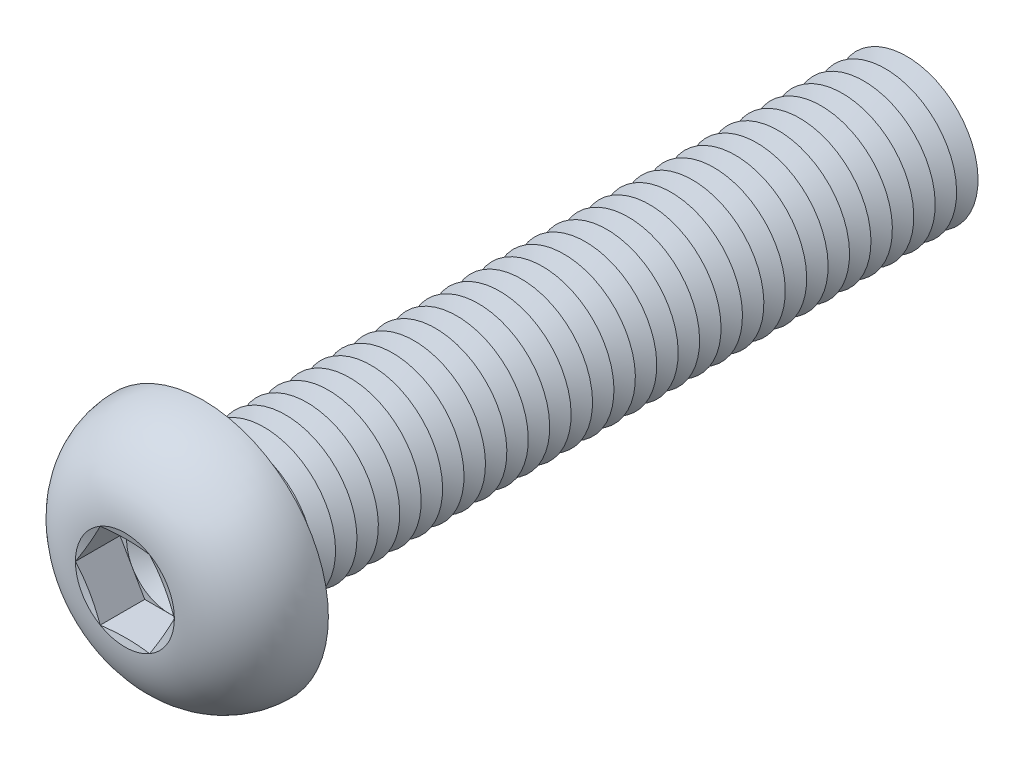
ISO-10303-21;
HEADER;
FILE_DESCRIPTION(('STEP AP214'),'2;1');
FILE_NAME('part.step','',(''),(''),'','','');
FILE_SCHEMA(('AUTOMOTIVE_DESIGN { 1 0 10303 214 1 1 1 1 }'));
ENDSEC;
DATA;
#1=APPLICATION_CONTEXT('core data for automotive mechanical design processes');
#2=APPLICATION_PROTOCOL_DEFINITION('international standard','automotive_design',2000,#1);
#3=PRODUCT_CONTEXT('',#1,'mechanical');
#4=PRODUCT('Part','Part','',(#3));
#5=PRODUCT_RELATED_PRODUCT_CATEGORY('part','',(#4));
#6=PRODUCT_DEFINITION_FORMATION('','',#4);
#7=PRODUCT_DEFINITION_CONTEXT('part definition',#1,'design');
#8=PRODUCT_DEFINITION('design','',#6,#7);
#9=PRODUCT_DEFINITION_SHAPE('','',#8);
#10=(LENGTH_UNIT() NAMED_UNIT(*) SI_UNIT(.MILLI.,.METRE.));
#11=(NAMED_UNIT(*) PLANE_ANGLE_UNIT() SI_UNIT($,.RADIAN.));
#12=(NAMED_UNIT(*) SI_UNIT($,.STERADIAN.) SOLID_ANGLE_UNIT());
#13=UNCERTAINTY_MEASURE_WITH_UNIT(LENGTH_MEASURE(1.E-05),#10,'distance_accuracy_value','');
#14=(GEOMETRIC_REPRESENTATION_CONTEXT(3) GLOBAL_UNCERTAINTY_ASSIGNED_CONTEXT((#13)) GLOBAL_UNIT_ASSIGNED_CONTEXT((#10,
#11,#12)) REPRESENTATION_CONTEXT('',''));
#15=CARTESIAN_POINT('',(0.,0.,0.));
#16=DIRECTION('',(0.,0.,1.));
#17=DIRECTION('',(1.,0.,0.));
#18=AXIS2_PLACEMENT_3D('',#15,#16,#17);
#19=CARTESIAN_POINT('',(0.,0.,2.38));
#20=DIRECTION('',(0.,0.,1.));
#21=DIRECTION('',(1.,0.,0.));
#22=AXIS2_PLACEMENT_3D('',#19,#20,#21);
#23=PLANE('',#22);
#24=CARTESIAN_POINT('',(0.,0.,2.38));
#25=DIRECTION('',(0.,0.,1.));
#26=DIRECTION('',(1.,0.,0.));
#27=AXIS2_PLACEMENT_3D('',#24,#25,#26);
#28=CIRCLE('',#27,2.99999860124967);
#29=CARTESIAN_POINT('',(2.598075,1.49999930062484,2.38));
#30=VERTEX_POINT('',#29);
#31=CARTESIAN_POINT('',(0.,2.99999860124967,2.38));
#32=VERTEX_POINT('',#31);
#33=EDGE_CURVE('E118',#30,#32,#28,.T.);
#34=ORIENTED_EDGE('',*,*,#33,.F.);
#35=DIRECTION('',(-0.500000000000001,0.866025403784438,0.));
#36=VECTOR('',#35,1.);
#37=CARTESIAN_POINT('',(3.4641,0.,2.38));
#38=LINE('',#37,#36);
#39=CARTESIAN_POINT('',(1.73205,2.99999860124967,2.38));
#40=VERTEX_POINT('',#39);
#41=EDGE_CURVE('E125',#30,#40,#38,.T.);
#42=ORIENTED_EDGE('',*,*,#41,.T.);
#43=DIRECTION('',(-1.,0.,0.));
#44=VECTOR('',#43,1.);
#45=CARTESIAN_POINT('',(1.73205,2.99999860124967,2.38));
#46=LINE('',#45,#44);
#47=EDGE_CURVE('E136',#40,#32,#46,.T.);
#48=ORIENTED_EDGE('',*,*,#47,.T.);
#49=EDGE_LOOP('',(#34,#42,#48));
#50=FACE_BOUND('',#49,.T.);
#51=ADVANCED_FACE('F39',(#50),#23,.T.);
#52=CARTESIAN_POINT('',(0.,0.,2.38));
#53=DIRECTION('',(0.,0.,1.));
#54=DIRECTION('',(1.,0.,0.));
#55=AXIS2_PLACEMENT_3D('',#52,#53,#54);
#56=CIRCLE('',#55,2.99999860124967);
#57=CARTESIAN_POINT('',(-2.598075,1.49999930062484,2.38));
#58=VERTEX_POINT('',#57);
#59=EDGE_CURVE('E11',#32,#58,#56,.T.);
#60=ORIENTED_EDGE('',*,*,#59,.F.);
#61=CARTESIAN_POINT('',(-1.73205,2.99999860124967,2.38));
#62=VERTEX_POINT('',#61);
#63=EDGE_CURVE('E131',#32,#62,#46,.T.);
#64=ORIENTED_EDGE('',*,*,#63,.T.);
#65=DIRECTION('',(-0.5,-0.866025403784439,0.));
#66=VECTOR('',#65,1.);
#67=CARTESIAN_POINT('',(-1.73205,2.99999860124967,2.38));
#68=LINE('',#67,#66);
#69=EDGE_CURVE('E134',#62,#58,#68,.T.);
#70=ORIENTED_EDGE('',*,*,#69,.T.);
#71=EDGE_LOOP('',(#60,#64,#70));
#72=FACE_BOUND('',#71,.T.);
#73=ADVANCED_FACE('F130',(#72),#23,.T.);
#74=CARTESIAN_POINT('',(-2.598075,-1.49999930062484,2.38));
#75=VERTEX_POINT('',#74);
#76=EDGE_CURVE('E49',#58,#75,#56,.T.);
#77=ORIENTED_EDGE('',*,*,#76,.F.);
#78=CARTESIAN_POINT('',(-3.4641,0.,2.38));
#79=VERTEX_POINT('',#78);
#80=EDGE_CURVE('E143',#58,#79,#68,.T.);
#81=ORIENTED_EDGE('',*,*,#80,.T.);
#82=DIRECTION('',(0.5,-0.866025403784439,0.));
#83=VECTOR('',#82,1.);
#84=CARTESIAN_POINT('',(-3.4641,0.,2.38));
#85=LINE('',#84,#83);
#86=EDGE_CURVE('E152',#79,#75,#85,.T.);
#87=ORIENTED_EDGE('',*,*,#86,.T.);
#88=EDGE_LOOP('',(#77,#81,#87));
#89=FACE_BOUND('',#88,.T.);
#90=ADVANCED_FACE('F536',(#89),#23,.T.);
#91=CARTESIAN_POINT('',(0.,-2.99999860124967,2.38));
#92=VERTEX_POINT('',#91);
#93=EDGE_CURVE('E552',#75,#92,#56,.T.);
#94=ORIENTED_EDGE('',*,*,#93,.F.);
#95=CARTESIAN_POINT('',(-1.73205,-2.99999860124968,2.38));
#96=VERTEX_POINT('',#95);
#97=EDGE_CURVE('E151',#75,#96,#85,.T.);
#98=ORIENTED_EDGE('',*,*,#97,.T.);
#99=DIRECTION('',(1.,0.,0.));
#100=VECTOR('',#99,1.);
#101=CARTESIAN_POINT('',(-1.73205,-2.99999860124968,2.38));
#102=LINE('',#101,#100);
#103=EDGE_CURVE('E157',#96,#92,#102,.T.);
#104=ORIENTED_EDGE('',*,*,#103,.T.);
#105=EDGE_LOOP('',(#94,#98,#104));
#106=FACE_BOUND('',#105,.T.);
#107=ADVANCED_FACE('F543',(#106),#23,.T.);
#108=CARTESIAN_POINT('',(2.598075,-1.49999930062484,2.38));
#109=VERTEX_POINT('',#108);
#110=EDGE_CURVE('E56',#92,#109,#56,.T.);
#111=ORIENTED_EDGE('',*,*,#110,.F.);
#112=CARTESIAN_POINT('',(1.73205,-2.99999860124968,2.38));
#113=VERTEX_POINT('',#112);
#114=EDGE_CURVE('E156',#92,#113,#102,.T.);
#115=ORIENTED_EDGE('',*,*,#114,.T.);
#116=DIRECTION('',(0.5,0.866025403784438,0.));
#117=VECTOR('',#116,1.);
#118=CARTESIAN_POINT('',(1.73205,-2.99999860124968,2.38));
#119=LINE('',#118,#117);
#120=EDGE_CURVE('E162',#113,#109,#119,.T.);
#121=ORIENTED_EDGE('',*,*,#120,.T.);
#122=EDGE_LOOP('',(#111,#115,#121));
#123=FACE_BOUND('',#122,.T.);
#124=ADVANCED_FACE('F539',(#123),#23,.T.);
#125=CARTESIAN_POINT('',(0.,0.,5.5));
#126=DIRECTION('',(0.,0.,1.));
#127=DIRECTION('',(0.,-1.,0.));
#128=AXIS2_PLACEMENT_3D('',#125,#126,#127);
#129=CONICAL_SURFACE('',#128,3.4641,1.30899693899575);
#130=CARTESIAN_POINT('',(3.46421547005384,-0.00020000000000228,5.50003094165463));
#131=CARTESIAN_POINT('',(3.39227822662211,0.124398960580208,5.48074619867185));
#132=CARTESIAN_POINT('',(3.32021054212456,0.249223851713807,5.46323875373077));
#133=CARTESIAN_POINT('',(3.17582062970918,0.499314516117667,5.43247971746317));
#134=CARTESIAN_POINT('',(3.10349831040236,0.624580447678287,5.41922985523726));
#135=CARTESIAN_POINT('',(2.95903767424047,0.874793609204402,5.39775958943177));
#136=CARTESIAN_POINT('',(2.88690033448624,0.999739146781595,5.38951357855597));
#137=CARTESIAN_POINT('',(2.74253364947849,1.2497895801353,5.37845651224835));
#138=CARTESIAN_POINT('',(2.67030432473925,1.37489444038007,5.37564440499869));
#139=CARTESIAN_POINT('',(2.52584567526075,1.6251041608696,5.37564440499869));
#140=CARTESIAN_POINT('',(2.45361635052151,1.75020902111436,5.37845651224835));
#141=CARTESIAN_POINT('',(2.30924966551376,2.00025945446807,5.38951357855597));
#142=CARTESIAN_POINT('',(2.23711232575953,2.12520499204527,5.39775958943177));
#143=CARTESIAN_POINT('',(2.09265168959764,2.37541815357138,5.41922985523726));
#144=CARTESIAN_POINT('',(2.02032937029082,2.500684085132,5.43247971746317));
#145=CARTESIAN_POINT('',(1.87593945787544,2.75077474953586,5.46323875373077));
#146=CARTESIAN_POINT('',(1.80387177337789,2.87559964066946,5.48074619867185));
#147=CARTESIAN_POINT('',(1.73193452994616,3.00019860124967,5.50003094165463));
#148=B_SPLINE_CURVE_WITH_KNOTS('',3,(#130,#131,#132,#133,#134,#135,#136,#137,#138,#139,#140,
#141,#142,#143,#144,#145,#146,#147),.UNSPECIFIED.,.F.,.F.,(4,2,2,2,2,2,2,2,4),(0.,
0.435506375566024,0.871189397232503,1.3046235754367,1.7379738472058,2.1713241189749,
2.6047582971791,3.04044131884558,3.4759476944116),.UNSPECIFIED.);
#149=CARTESIAN_POINT('',(3.4641,0.,5.5));
#150=VERTEX_POINT('',#149);
#151=CARTESIAN_POINT('',(1.73204999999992,2.99999860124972,5.5));
#152=VERTEX_POINT('',#151);
#153=EDGE_CURVE('E229',#150,#152,#148,.T.);
#154=ORIENTED_EDGE('',*,*,#153,.F.);
#155=CARTESIAN_POINT('',(0.,0.,5.5));
#156=DIRECTION('',(0.,0.,-1.));
#157=DIRECTION('',(0.,1.,0.));
#158=AXIS2_PLACEMENT_3D('',#155,#156,#157);
#159=CIRCLE('',#158,3.4641);
#160=EDGE_CURVE('E307',#152,#150,#159,.T.);
#161=ORIENTED_EDGE('',*,*,#160,.F.);
#162=EDGE_LOOP('',(#154,#161));
#163=FACE_BOUND('',#162,.T.);
#164=ADVANCED_FACE('F530',(#163),#129,.F.);
#165=CARTESIAN_POINT('',(1.73193452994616,-3.00019860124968,5.50003094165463));
#166=CARTESIAN_POINT('',(1.80387177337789,-2.87559964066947,5.48074619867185));
#167=CARTESIAN_POINT('',(1.87593945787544,-2.75077474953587,5.46323875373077));
#168=CARTESIAN_POINT('',(2.02032937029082,-2.50068408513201,5.43247971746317));
#169=CARTESIAN_POINT('',(2.09265168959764,-2.37541815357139,5.41922985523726));
#170=CARTESIAN_POINT('',(2.23711232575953,-2.12520499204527,5.39775958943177));
#171=CARTESIAN_POINT('',(2.30924966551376,-2.00025945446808,5.38951357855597));
#172=CARTESIAN_POINT('',(2.45361635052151,-1.75020902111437,5.37845651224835));
#173=CARTESIAN_POINT('',(2.52584567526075,-1.6251041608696,5.37564440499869));
#174=CARTESIAN_POINT('',(2.67030432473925,-1.37489444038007,5.37564440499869));
#175=CARTESIAN_POINT('',(2.74253364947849,-1.24978958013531,5.37845651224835));
#176=CARTESIAN_POINT('',(2.88690033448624,-0.999739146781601,5.38951357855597));
#177=CARTESIAN_POINT('',(2.95903767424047,-0.874793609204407,5.39775958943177));
#178=CARTESIAN_POINT('',(3.10349831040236,-0.624580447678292,5.41922985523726));
#179=CARTESIAN_POINT('',(3.17582062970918,-0.499314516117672,5.43247971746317));
#180=CARTESIAN_POINT('',(3.32021054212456,-0.249223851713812,5.46323875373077));
#181=CARTESIAN_POINT('',(3.39227822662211,-0.124398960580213,5.48074619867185));
#182=CARTESIAN_POINT('',(3.46421547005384,0.000199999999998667,5.50003094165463));
#183=B_SPLINE_CURVE_WITH_KNOTS('',3,(#165,#166,#167,#168,#169,#170,#171,#172,#173,#174,#175,
#176,#177,#178,#179,#180,#181,#182),.UNSPECIFIED.,.F.,.F.,(4,2,2,2,2,2,2,2,4),(0.,
0.435506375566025,0.871189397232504,1.3046235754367,1.7379738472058,2.1713241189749,
2.6047582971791,3.04044131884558,3.4759476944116),.UNSPECIFIED.);
#184=CARTESIAN_POINT('',(1.73205,-2.99999860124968,5.5));
#185=VERTEX_POINT('',#184);
#186=EDGE_CURVE('E232',#185,#150,#183,.T.);
#187=ORIENTED_EDGE('',*,*,#186,.F.);
#188=EDGE_CURVE('E290',#150,#185,#159,.T.);
#189=ORIENTED_EDGE('',*,*,#188,.F.);
#190=EDGE_LOOP('',(#187,#189));
#191=FACE_BOUND('',#190,.T.);
#192=ADVANCED_FACE('F288',(#191),#129,.F.);
#193=CARTESIAN_POINT('',(-5.2273006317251,-2.99999860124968,6.18672552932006));
#194=CARTESIAN_POINT('',(-5.10075887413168,-2.99999860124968,6.1573201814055));
#195=CARTESIAN_POINT('',(-4.97415993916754,-2.99999860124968,6.12816064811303));
#196=CARTESIAN_POINT('',(-4.72082394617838,-2.99999860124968,6.07043857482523));
#197=CARTESIAN_POINT('',(-4.59408688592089,-2.99999860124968,6.04187604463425));
#198=CARTESIAN_POINT('',(-4.21358997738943,-2.99999860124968,5.95723252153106));
#199=CARTESIAN_POINT('',(-3.95959339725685,-2.99999860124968,5.90220706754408));
#200=CARTESIAN_POINT('',(-3.44835573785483,-2.99999860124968,5.79574115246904));
#201=CARTESIAN_POINT('',(-3.19110656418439,-2.99999860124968,5.744339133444));
#202=CARTESIAN_POINT('',(-2.67540790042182,-2.99999860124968,5.64772994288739));
#203=CARTESIAN_POINT('',(-2.41695830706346,-2.99999860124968,5.60252331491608));
#204=CARTESIAN_POINT('',(-1.9055512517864,-2.99999860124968,5.52251897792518));
#205=CARTESIAN_POINT('',(-1.65263426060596,-2.99999860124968,5.48747285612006));
#206=CARTESIAN_POINT('',(-1.27220564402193,-2.99999860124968,5.44439602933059));
#207=CARTESIAN_POINT('',(-1.1452320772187,-2.99999860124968,5.43161987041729));
#208=CARTESIAN_POINT('',(-0.890973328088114,-2.99999860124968,5.40972605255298));
#209=CARTESIAN_POINT('',(-0.763688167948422,-2.99999860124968,5.40060814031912));
#210=CARTESIAN_POINT('',(-0.509442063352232,-2.99999860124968,5.38647457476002));
#211=CARTESIAN_POINT('',(-0.382482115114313,-2.99999860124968,5.38144125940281));
#212=CARTESIAN_POINT('',(-0.128463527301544,-2.99999860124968,5.37566637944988));
#213=CARTESIAN_POINT('',(-0.00140488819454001,-2.99999860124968,5.37492479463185));
#214=CARTESIAN_POINT('',(0.252672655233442,-2.99999860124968,5.37777315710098));
#215=CARTESIAN_POINT('',(0.379691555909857,-2.99999860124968,5.38136342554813));
#216=CARTESIAN_POINT('',(0.633540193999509,-2.99999860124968,5.39268816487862));
#217=CARTESIAN_POINT('',(0.76036993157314,-2.99999860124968,5.40042263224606));
#218=CARTESIAN_POINT('',(1.06836981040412,-2.99999860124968,5.42382465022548));
#219=CARTESIAN_POINT('',(1.24938929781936,-2.99999860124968,5.4414748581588));
#220=CARTESIAN_POINT('',(1.61066786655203,-2.99999860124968,5.48312309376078));
#221=CARTESIAN_POINT('',(1.7909269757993,-2.99999860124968,5.50712088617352));
#222=CARTESIAN_POINT('',(2.15127612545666,-2.99999860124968,5.56013471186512));
#223=CARTESIAN_POINT('',(2.33136383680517,-2.99999860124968,5.58916634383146));
#224=CARTESIAN_POINT('',(2.690892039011,-2.99999860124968,5.65100028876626));
#225=CARTESIAN_POINT('',(2.87033249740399,-2.99999860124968,5.6838027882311));
#226=CARTESIAN_POINT('',(3.23235399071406,-2.99999860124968,5.75295369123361));
#227=CARTESIAN_POINT('',(3.4149236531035,-2.99999860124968,5.78936117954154));
#228=CARTESIAN_POINT('',(3.77960351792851,-2.99999860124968,5.86440648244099));
#229=CARTESIAN_POINT('',(3.96171371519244,-2.99999860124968,5.903044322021));
#230=CARTESIAN_POINT('',(4.32457472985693,-2.99999860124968,5.98179660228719));
#231=CARTESIAN_POINT('',(4.5053275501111,-2.99999860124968,6.02190185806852));
#232=CARTESIAN_POINT('',(4.86652484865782,-2.99999860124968,6.10342152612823));
#233=CARTESIAN_POINT('',(5.04696934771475,-2.99999860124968,6.14483584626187));
#234=CARTESIAN_POINT('',(5.2273006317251,-2.99999860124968,6.18672552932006));
#235=B_SPLINE_CURVE_WITH_KNOTS('',3,(#193,#194,#195,#196,#197,#198,#199,#200,#201,#202,#203,
#204,#205,#206,#207,#208,#209,#210,#211,#212,#213,#214,#215,#216,#217,#218,#219,#220,#221,#222,
#223,#224,#225,#226,#227,#228,#229,#230,#231,#232,#233,#234),.UNSPECIFIED.,.F.,.F.,(4,2,2,2,2,2,
2,2,2,2,2,2,2,2,2,2,2,2,2,2,4),(0.,0.389739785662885,0.779485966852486,1.5591292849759,
2.34608117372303,3.13310206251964,3.8988410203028,4.28164148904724,4.66441544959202,
5.04552531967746,5.42663339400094,5.80776972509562,6.18890573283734,6.73438998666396,
7.27985402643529,7.8270395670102,8.37425218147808,8.93272720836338,9.49120849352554,
10.0466490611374,10.6020506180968),.UNSPECIFIED.);
#236=CARTESIAN_POINT('',(-1.73205,-2.99999860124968,5.5));
#237=VERTEX_POINT('',#236);
#238=EDGE_CURVE('E241',#237,#185,#235,.T.);
#239=ORIENTED_EDGE('',*,*,#238,.F.);
#240=EDGE_CURVE('E295',#185,#237,#159,.T.);
#241=ORIENTED_EDGE('',*,*,#240,.F.);
#242=EDGE_LOOP('',(#239,#241));
#243=FACE_BOUND('',#242,.T.);
#244=ADVANCED_FACE('F296',(#243),#129,.F.);
#245=CARTESIAN_POINT('',(-3.46421547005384,0.000199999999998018,5.50003094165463));
#246=CARTESIAN_POINT('',(-3.39227822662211,-0.124398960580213,5.48074619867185));
#247=CARTESIAN_POINT('',(-3.32021054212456,-0.249223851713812,5.46323875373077));
#248=CARTESIAN_POINT('',(-3.17582062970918,-0.499314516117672,5.43247971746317));
#249=CARTESIAN_POINT('',(-3.10349831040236,-0.624580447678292,5.41922985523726));
#250=CARTESIAN_POINT('',(-2.95903767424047,-0.874793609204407,5.39775958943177));
#251=CARTESIAN_POINT('',(-2.88690033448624,-0.999739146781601,5.38951357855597));
#252=CARTESIAN_POINT('',(-2.74253364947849,-1.24978958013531,5.37845651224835));
#253=CARTESIAN_POINT('',(-2.67030432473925,-1.37489444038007,5.37564440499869));
#254=CARTESIAN_POINT('',(-2.52584567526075,-1.6251041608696,5.37564440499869));
#255=CARTESIAN_POINT('',(-2.45361635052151,-1.75020902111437,5.37845651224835));
#256=CARTESIAN_POINT('',(-2.30924966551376,-2.00025945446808,5.38951357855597));
#257=CARTESIAN_POINT('',(-2.23711232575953,-2.12520499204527,5.39775958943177));
#258=CARTESIAN_POINT('',(-2.09265168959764,-2.37541815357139,5.41922985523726));
#259=CARTESIAN_POINT('',(-2.02032937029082,-2.50068408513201,5.43247971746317));
#260=CARTESIAN_POINT('',(-1.87593945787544,-2.75077474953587,5.46323875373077));
#261=CARTESIAN_POINT('',(-1.80387177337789,-2.87559964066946,5.48074619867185));
#262=CARTESIAN_POINT('',(-1.73193452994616,-3.00019860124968,5.50003094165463));
#263=B_SPLINE_CURVE_WITH_KNOTS('',3,(#245,#246,#247,#248,#249,#250,#251,#252,#253,#254,#255,
#256,#257,#258,#259,#260,#261,#262),.UNSPECIFIED.,.F.,.F.,(4,2,2,2,2,2,2,2,4),(0.,
0.435506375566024,0.871189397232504,1.3046235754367,1.7379738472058,2.1713241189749,
2.6047582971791,3.04044131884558,3.4759476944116),.UNSPECIFIED.);
#264=CARTESIAN_POINT('',(-3.4641,0.,5.5));
#265=VERTEX_POINT('',#264);
#266=EDGE_CURVE('E237',#265,#237,#263,.T.);
#267=ORIENTED_EDGE('',*,*,#266,.F.);
#268=EDGE_CURVE('E301',#237,#265,#159,.T.);
#269=ORIENTED_EDGE('',*,*,#268,.F.);
#270=EDGE_LOOP('',(#267,#269));
#271=FACE_BOUND('',#270,.T.);
#272=ADVANCED_FACE('F1266',(#271),#129,.F.);
#273=CARTESIAN_POINT('',(-1.73193452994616,3.00019860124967,5.50003094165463));
#274=CARTESIAN_POINT('',(-1.8038717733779,2.87559964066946,5.48074619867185));
#275=CARTESIAN_POINT('',(-1.87593945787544,2.75077474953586,5.46323875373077));
#276=CARTESIAN_POINT('',(-2.02032937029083,2.500684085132,5.43247971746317));
#277=CARTESIAN_POINT('',(-2.09265168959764,2.37541815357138,5.41922985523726));
#278=CARTESIAN_POINT('',(-2.23711232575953,2.12520499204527,5.39775958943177));
#279=CARTESIAN_POINT('',(-2.30924966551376,2.00025945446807,5.38951357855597));
#280=CARTESIAN_POINT('',(-2.45361635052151,1.75020902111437,5.37845651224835));
#281=CARTESIAN_POINT('',(-2.52584567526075,1.6251041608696,5.37564440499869));
#282=CARTESIAN_POINT('',(-2.67030432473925,1.37489444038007,5.37564440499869));
#283=CARTESIAN_POINT('',(-2.74253364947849,1.2497895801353,5.37845651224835));
#284=CARTESIAN_POINT('',(-2.88690033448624,0.999739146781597,5.38951357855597));
#285=CARTESIAN_POINT('',(-2.95903767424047,0.874793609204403,5.39775958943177));
#286=CARTESIAN_POINT('',(-3.10349831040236,0.624580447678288,5.41922985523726));
#287=CARTESIAN_POINT('',(-3.17582062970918,0.499314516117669,5.43247971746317));
#288=CARTESIAN_POINT('',(-3.32021054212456,0.249223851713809,5.46323875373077));
#289=CARTESIAN_POINT('',(-3.39227822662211,0.12439896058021,5.48074619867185));
#290=CARTESIAN_POINT('',(-3.46421547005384,-0.000200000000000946,5.50003094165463));
#291=B_SPLINE_CURVE_WITH_KNOTS('',3,(#273,#274,#275,#276,#277,#278,#279,#280,#281,#282,#283,
#284,#285,#286,#287,#288,#289,#290),.UNSPECIFIED.,.F.,.F.,(4,2,2,2,2,2,2,2,4),(0.,
0.435506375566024,0.871189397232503,1.3046235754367,1.7379738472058,2.1713241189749,
2.6047582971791,3.04044131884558,3.4759476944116),.UNSPECIFIED.);
#292=CARTESIAN_POINT('',(-1.73205,2.99999860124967,5.5));
#293=VERTEX_POINT('',#292);
#294=EDGE_CURVE('E234',#293,#265,#291,.T.);
#295=ORIENTED_EDGE('',*,*,#294,.F.);
#296=EDGE_CURVE('E319',#265,#293,#159,.T.);
#297=ORIENTED_EDGE('',*,*,#296,.F.);
#298=EDGE_LOOP('',(#295,#297));
#299=FACE_BOUND('',#298,.T.);
#300=ADVANCED_FACE('F531',(#299),#129,.F.);
#301=CARTESIAN_POINT('',(0.,0.,-44.75));
#302=DIRECTION('',(0.,0.,1.));
#303=DIRECTION('',(0.,-1.,0.));
#304=AXIS2_PLACEMENT_3D('',#301,#302,#303);
#305=CONICAL_SURFACE('',#304,4.99999999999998,1.0471975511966);
#306=CARTESIAN_POINT('',(0.,0.,-45.5));
#307=DIRECTION('',(0.,0.,1.));
#308=DIRECTION('',(0.,-1.,0.));
#309=AXIS2_PLACEMENT_3D('',#306,#307,#308);
#310=CIRCLE('',#309,3.70096189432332);
#311=CARTESIAN_POINT('',(0.,-3.7009618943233,-45.5));
#312=VERTEX_POINT('',#311);
#313=EDGE_CURVE('E492',#312,#312,#310,.T.);
#314=ORIENTED_EDGE('',*,*,#313,.T.);
#315=EDGE_LOOP('',(#314));
#316=FACE_BOUND('',#315,.T.);
#317=CARTESIAN_POINT('',(0.,0.,-44.75));
#318=DIRECTION('',(0.,0.,1.));
#319=DIRECTION('',(0.,-1.,0.));
#320=AXIS2_PLACEMENT_3D('',#317,#318,#319);
#321=CIRCLE('',#320,4.99999999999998);
#322=CARTESIAN_POINT('',(0.,-4.99999999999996,-44.75));
#323=VERTEX_POINT('',#322);
#324=EDGE_CURVE('E488',#323,#323,#321,.T.);
#325=ORIENTED_EDGE('',*,*,#324,.F.);
#326=EDGE_LOOP('',(#325));
#327=FACE_BOUND('',#326,.T.);
#328=ADVANCED_FACE('F851',(#316,#327),#305,.T.);
#329=CARTESIAN_POINT('',(0.,0.,-45.5));
#330=DIRECTION('',(0.,0.,-1.));
#331=DIRECTION('',(0.,1.,0.));
#332=AXIS2_PLACEMENT_3D('',#329,#330,#331);
#333=CONICAL_SURFACE('',#332,3.70096189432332,1.0471975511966);
#334=CARTESIAN_POINT('',(0.,0.,-46.25));
#335=DIRECTION('',(0.,0.,1.));
#336=DIRECTION('',(0.,-1.,0.));
#337=AXIS2_PLACEMENT_3D('',#334,#335,#336);
#338=CIRCLE('',#337,4.99999999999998);
#339=CARTESIAN_POINT('',(0.,-4.99999999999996,-46.25));
#340=VERTEX_POINT('',#339);
#341=EDGE_CURVE('E496',#340,#340,#338,.T.);
#342=ORIENTED_EDGE('',*,*,#341,.T.);
#343=EDGE_LOOP('',(#342));
#344=FACE_BOUND('',#343,.T.);
#345=ORIENTED_EDGE('',*,*,#313,.F.);
#346=EDGE_LOOP('',(#345));
#347=FACE_BOUND('',#346,.T.);
#348=ADVANCED_FACE('F847',(#344,#347),#333,.T.);
#349=CARTESIAN_POINT('',(0.,4.99999999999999,-50.));
#350=DIRECTION('',(0.,0.,-1.));
#351=DIRECTION('',(0.,1.,0.));
#352=AXIS2_PLACEMENT_3D('',#349,#350,#351);
#353=PLANE('',#352);
#354=CARTESIAN_POINT('',(0.,0.,-50.));
#355=DIRECTION('',(0.,0.,1.));
#356=DIRECTION('',(0.,-1.,0.));
#357=AXIS2_PLACEMENT_3D('',#354,#355,#356);
#358=CIRCLE('',#357,3.70096189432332);
#359=CARTESIAN_POINT('',(0.,-3.7009618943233,-50.));
#360=VERTEX_POINT('',#359);
#361=EDGE_CURVE('E325',#360,#360,#358,.T.);
#362=ORIENTED_EDGE('',*,*,#361,.F.);
#363=EDGE_LOOP('',(#362));
#364=FACE_BOUND('',#363,.T.);
#365=ADVANCED_FACE('F850',(#364),#353,.T.);
#366=CARTESIAN_POINT('',(0.,0.,-49.25));
#367=DIRECTION('',(0.,0.,1.));
#368=DIRECTION('',(0.,-1.,0.));
#369=AXIS2_PLACEMENT_3D('',#366,#367,#368);
#370=CONICAL_SURFACE('',#369,4.99999999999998,1.0471975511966);
#371=ORIENTED_EDGE('',*,*,#361,.T.);
#372=EDGE_LOOP('',(#371));
#373=FACE_BOUND('',#372,.T.);
#374=CARTESIAN_POINT('',(0.,0.,-49.25));
#375=DIRECTION('',(0.,0.,1.));
#376=DIRECTION('',(0.,-1.,0.));
#377=AXIS2_PLACEMENT_3D('',#374,#375,#376);
#378=CIRCLE('',#377,4.99999999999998);
#379=CARTESIAN_POINT('',(0.,-4.99999999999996,-49.25));
#380=VERTEX_POINT('',#379);
#381=EDGE_CURVE('E375',#380,#380,#378,.T.);
#382=ORIENTED_EDGE('',*,*,#381,.F.);
#383=EDGE_LOOP('',(#382));
#384=FACE_BOUND('',#383,.T.);
#385=ADVANCED_FACE('F867',(#373,#384),#370,.T.);
#386=CARTESIAN_POINT('',(0.,0.,-48.5));
#387=DIRECTION('',(0.,0.,-1.));
#388=DIRECTION('',(0.,1.,0.));
#389=AXIS2_PLACEMENT_3D('',#386,#387,#388);
#390=CONICAL_SURFACE('',#389,3.70096189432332,1.0471975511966);
#391=ORIENTED_EDGE('',*,*,#381,.T.);
#392=EDGE_LOOP('',(#391));
#393=FACE_BOUND('',#392,.T.);
#394=CARTESIAN_POINT('',(0.,0.,-48.5));
#395=DIRECTION('',(0.,0.,1.));
#396=DIRECTION('',(0.,-1.,0.));
#397=AXIS2_PLACEMENT_3D('',#394,#395,#396);
#398=CIRCLE('',#397,3.70096189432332);
#399=CARTESIAN_POINT('',(0.,-3.7009618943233,-48.5));
#400=VERTEX_POINT('',#399);
#401=EDGE_CURVE('E508',#400,#400,#398,.T.);
#402=ORIENTED_EDGE('',*,*,#401,.F.);
#403=EDGE_LOOP('',(#402));
#404=FACE_BOUND('',#403,.T.);
#405=ADVANCED_FACE('F864',(#393,#404),#390,.T.);
#406=CARTESIAN_POINT('',(0.,0.,-47.75));
#407=DIRECTION('',(0.,0.,1.));
#408=DIRECTION('',(0.,-1.,0.));
#409=AXIS2_PLACEMENT_3D('',#406,#407,#408);
#410=CONICAL_SURFACE('',#409,4.99999999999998,1.0471975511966);
#411=ORIENTED_EDGE('',*,*,#401,.T.);
#412=EDGE_LOOP('',(#411));
#413=FACE_BOUND('',#412,.T.);
#414=CARTESIAN_POINT('',(0.,0.,-47.75));
#415=DIRECTION('',(0.,0.,1.));
#416=DIRECTION('',(0.,-1.,0.));
#417=AXIS2_PLACEMENT_3D('',#414,#415,#416);
#418=CIRCLE('',#417,4.99999999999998);
#419=CARTESIAN_POINT('',(0.,-4.99999999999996,-47.75));
#420=VERTEX_POINT('',#419);
#421=EDGE_CURVE('E504',#420,#420,#418,.T.);
#422=ORIENTED_EDGE('',*,*,#421,.F.);
#423=EDGE_LOOP('',(#422));
#424=FACE_BOUND('',#423,.T.);
#425=ADVANCED_FACE('F859',(#413,#424),#410,.T.);
#426=CARTESIAN_POINT('',(0.,0.,-47.));
#427=DIRECTION('',(0.,0.,-1.));
#428=DIRECTION('',(0.,1.,0.));
#429=AXIS2_PLACEMENT_3D('',#426,#427,#428);
#430=CONICAL_SURFACE('',#429,3.70096189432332,1.0471975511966);
#431=ORIENTED_EDGE('',*,*,#421,.T.);
#432=EDGE_LOOP('',(#431));
#433=FACE_BOUND('',#432,.T.);
#434=CARTESIAN_POINT('',(0.,0.,-47.));
#435=DIRECTION('',(0.,0.,1.));
#436=DIRECTION('',(0.,-1.,0.));
#437=AXIS2_PLACEMENT_3D('',#434,#435,#436);
#438=CIRCLE('',#437,3.70096189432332);
#439=CARTESIAN_POINT('',(0.,-3.7009618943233,-47.));
#440=VERTEX_POINT('',#439);
#441=EDGE_CURVE('E500',#440,#440,#438,.T.);
#442=ORIENTED_EDGE('',*,*,#441,.F.);
#443=EDGE_LOOP('',(#442));
#444=FACE_BOUND('',#443,.T.);
#445=ADVANCED_FACE('F856',(#433,#444),#430,.T.);
#446=CARTESIAN_POINT('',(0.,0.,-46.25));
#447=DIRECTION('',(0.,0.,1.));
#448=DIRECTION('',(0.,-1.,0.));
#449=AXIS2_PLACEMENT_3D('',#446,#447,#448);
#450=CONICAL_SURFACE('',#449,4.99999999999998,1.0471975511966);
#451=ORIENTED_EDGE('',*,*,#441,.T.);
#452=EDGE_LOOP('',(#451));
#453=FACE_BOUND('',#452,.T.);
#454=ORIENTED_EDGE('',*,*,#341,.F.);
#455=EDGE_LOOP('',(#454));
#456=FACE_BOUND('',#455,.T.);
#457=ADVANCED_FACE('F845',(#453,#456),#450,.T.);
#458=CARTESIAN_POINT('',(0.,0.,-43.25));
#459=DIRECTION('',(0.,0.,1.));
#460=DIRECTION('',(0.,-1.,0.));
#461=AXIS2_PLACEMENT_3D('',#458,#459,#460);
#462=CONICAL_SURFACE('',#461,4.99999999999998,1.0471975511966);
#463=CARTESIAN_POINT('',(0.,0.,-44.));
#464=DIRECTION('',(0.,0.,1.));
#465=DIRECTION('',(0.,-1.,0.));
#466=AXIS2_PLACEMENT_3D('',#463,#464,#465);
#467=CIRCLE('',#466,3.70096189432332);
#468=CARTESIAN_POINT('',(0.,-3.7009618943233,-44.));
#469=VERTEX_POINT('',#468);
#470=EDGE_CURVE('E355',#469,#469,#467,.T.);
#471=ORIENTED_EDGE('',*,*,#470,.T.);
#472=EDGE_LOOP('',(#471));
#473=FACE_BOUND('',#472,.T.);
#474=CARTESIAN_POINT('',(0.,0.,-43.25));
#475=DIRECTION('',(0.,0.,1.));
#476=DIRECTION('',(0.,-1.,0.));
#477=AXIS2_PLACEMENT_3D('',#474,#475,#476);
#478=CIRCLE('',#477,4.99999999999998);
#479=CARTESIAN_POINT('',(0.,-4.99999999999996,-43.25));
#480=VERTEX_POINT('',#479);
#481=EDGE_CURVE('E352',#480,#480,#478,.T.);
#482=ORIENTED_EDGE('',*,*,#481,.F.);
#483=EDGE_LOOP('',(#482));
#484=FACE_BOUND('',#483,.T.);
#485=ADVANCED_FACE('F841',(#473,#484),#462,.T.);
#486=CARTESIAN_POINT('',(0.,0.,-44.));
#487=DIRECTION('',(0.,0.,-1.));
#488=DIRECTION('',(0.,1.,0.));
#489=AXIS2_PLACEMENT_3D('',#486,#487,#488);
#490=CONICAL_SURFACE('',#489,3.70096189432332,1.0471975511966);
#491=ORIENTED_EDGE('',*,*,#324,.T.);
#492=EDGE_LOOP('',(#491));
#493=FACE_BOUND('',#492,.T.);
#494=ORIENTED_EDGE('',*,*,#470,.F.);
#495=EDGE_LOOP('',(#494));
#496=FACE_BOUND('',#495,.T.);
#497=ADVANCED_FACE('F837',(#493,#496),#490,.T.);
#498=CARTESIAN_POINT('',(0.,0.,-41.75));
#499=DIRECTION('',(0.,0.,1.));
#500=DIRECTION('',(0.,-1.,0.));
#501=AXIS2_PLACEMENT_3D('',#498,#499,#500);
#502=CONICAL_SURFACE('',#501,4.99999999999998,1.0471975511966);
#503=CARTESIAN_POINT('',(0.,0.,-42.5));
#504=DIRECTION('',(0.,0.,1.));
#505=DIRECTION('',(0.,-1.,0.));
#506=AXIS2_PLACEMENT_3D('',#503,#504,#505);
#507=CIRCLE('',#506,3.70096189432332);
#508=CARTESIAN_POINT('',(0.,-3.7009618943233,-42.5));
#509=VERTEX_POINT('',#508);
#510=EDGE_CURVE('E356',#509,#509,#507,.T.);
#511=ORIENTED_EDGE('',*,*,#510,.T.);
#512=EDGE_LOOP('',(#511));
#513=FACE_BOUND('',#512,.T.);
#514=CARTESIAN_POINT('',(0.,0.,-41.75));
#515=DIRECTION('',(0.,0.,1.));
#516=DIRECTION('',(0.,-1.,0.));
#517=AXIS2_PLACEMENT_3D('',#514,#515,#516);
#518=CIRCLE('',#517,4.99999999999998);
#519=CARTESIAN_POINT('',(0.,-4.99999999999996,-41.75));
#520=VERTEX_POINT('',#519);
#521=EDGE_CURVE('E372',#520,#520,#518,.T.);
#522=ORIENTED_EDGE('',*,*,#521,.F.);
#523=EDGE_LOOP('',(#522));
#524=FACE_BOUND('',#523,.T.);
#525=ADVANCED_FACE('F833',(#513,#524),#502,.T.);
#526=CARTESIAN_POINT('',(0.,0.,-42.5));
#527=DIRECTION('',(0.,0.,-1.));
#528=DIRECTION('',(0.,1.,0.));
#529=AXIS2_PLACEMENT_3D('',#526,#527,#528);
#530=CONICAL_SURFACE('',#529,3.70096189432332,1.0471975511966);
#531=ORIENTED_EDGE('',*,*,#481,.T.);
#532=EDGE_LOOP('',(#531));
#533=FACE_BOUND('',#532,.T.);
#534=ORIENTED_EDGE('',*,*,#510,.F.);
#535=EDGE_LOOP('',(#534));
#536=FACE_BOUND('',#535,.T.);
#537=ADVANCED_FACE('F829',(#533,#536),#530,.T.);
#538=CARTESIAN_POINT('',(0.,0.,-40.25));
#539=DIRECTION('',(0.,0.,1.));
#540=DIRECTION('',(0.,-1.,0.));
#541=AXIS2_PLACEMENT_3D('',#538,#539,#540);
#542=CONICAL_SURFACE('',#541,4.99999999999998,1.0471975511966);
#543=CARTESIAN_POINT('',(0.,0.,-41.));
#544=DIRECTION('',(0.,0.,1.));
#545=DIRECTION('',(0.,-1.,0.));
#546=AXIS2_PLACEMENT_3D('',#543,#544,#545);
#547=CIRCLE('',#546,3.70096189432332);
#548=CARTESIAN_POINT('',(0.,-3.7009618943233,-41.));
#549=VERTEX_POINT('',#548);
#550=EDGE_CURVE('E416',#549,#549,#547,.T.);
#551=ORIENTED_EDGE('',*,*,#550,.T.);
#552=EDGE_LOOP('',(#551));
#553=FACE_BOUND('',#552,.T.);
#554=CARTESIAN_POINT('',(0.,0.,-40.25));
#555=DIRECTION('',(0.,0.,1.));
#556=DIRECTION('',(0.,-1.,0.));
#557=AXIS2_PLACEMENT_3D('',#554,#555,#556);
#558=CIRCLE('',#557,4.99999999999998);
#559=CARTESIAN_POINT('',(0.,-4.99999999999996,-40.25));
#560=VERTEX_POINT('',#559);
#561=EDGE_CURVE('E414',#560,#560,#558,.T.);
#562=ORIENTED_EDGE('',*,*,#561,.F.);
#563=EDGE_LOOP('',(#562));
#564=FACE_BOUND('',#563,.T.);
#565=ADVANCED_FACE('F825',(#553,#564),#542,.T.);
#566=CARTESIAN_POINT('',(0.,0.,-41.));
#567=DIRECTION('',(0.,0.,-1.));
#568=DIRECTION('',(0.,1.,0.));
#569=AXIS2_PLACEMENT_3D('',#566,#567,#568);
#570=CONICAL_SURFACE('',#569,3.70096189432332,1.0471975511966);
#571=ORIENTED_EDGE('',*,*,#521,.T.);
#572=EDGE_LOOP('',(#571));
#573=FACE_BOUND('',#572,.T.);
#574=ORIENTED_EDGE('',*,*,#550,.F.);
#575=EDGE_LOOP('',(#574));
#576=FACE_BOUND('',#575,.T.);
#577=ADVANCED_FACE('F821',(#573,#576),#570,.T.);
#578=CARTESIAN_POINT('',(0.,0.,-38.75));
#579=DIRECTION('',(0.,0.,1.));
#580=DIRECTION('',(0.,-1.,0.));
#581=AXIS2_PLACEMENT_3D('',#578,#579,#580);
#582=CONICAL_SURFACE('',#581,4.99999999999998,1.0471975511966);
#583=CARTESIAN_POINT('',(0.,0.,-39.5));
#584=DIRECTION('',(0.,0.,1.));
#585=DIRECTION('',(0.,-1.,0.));
#586=AXIS2_PLACEMENT_3D('',#583,#584,#585);
#587=CIRCLE('',#586,3.70096189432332);
#588=CARTESIAN_POINT('',(0.,-3.7009618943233,-39.5));
#589=VERTEX_POINT('',#588);
#590=EDGE_CURVE('E392',#589,#589,#587,.T.);
#591=ORIENTED_EDGE('',*,*,#590,.T.);
#592=EDGE_LOOP('',(#591));
#593=FACE_BOUND('',#592,.T.);
#594=CARTESIAN_POINT('',(0.,0.,-38.75));
#595=DIRECTION('',(0.,0.,1.));
#596=DIRECTION('',(0.,-1.,0.));
#597=AXIS2_PLACEMENT_3D('',#594,#595,#596);
#598=CIRCLE('',#597,4.99999999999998);
#599=CARTESIAN_POINT('',(0.,-4.99999999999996,-38.75));
#600=VERTEX_POINT('',#599);
#601=EDGE_CURVE('E390',#600,#600,#598,.T.);
#602=ORIENTED_EDGE('',*,*,#601,.F.);
#603=EDGE_LOOP('',(#602));
#604=FACE_BOUND('',#603,.T.);
#605=ADVANCED_FACE('F817',(#593,#604),#582,.T.);
#606=CARTESIAN_POINT('',(0.,0.,-39.5));
#607=DIRECTION('',(0.,0.,-1.));
#608=DIRECTION('',(0.,1.,0.));
#609=AXIS2_PLACEMENT_3D('',#606,#607,#608);
#610=CONICAL_SURFACE('',#609,3.70096189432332,1.0471975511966);
#611=ORIENTED_EDGE('',*,*,#561,.T.);
#612=EDGE_LOOP('',(#611));
#613=FACE_BOUND('',#612,.T.);
#614=ORIENTED_EDGE('',*,*,#590,.F.);
#615=EDGE_LOOP('',(#614));
#616=FACE_BOUND('',#615,.T.);
#617=ADVANCED_FACE('F813',(#613,#616),#610,.T.);
#618=CARTESIAN_POINT('',(0.,0.,-37.25));
#619=DIRECTION('',(0.,0.,1.));
#620=DIRECTION('',(0.,-1.,0.));
#621=AXIS2_PLACEMENT_3D('',#618,#619,#620);
#622=CONICAL_SURFACE('',#621,4.99999999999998,1.0471975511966);
#623=CARTESIAN_POINT('',(0.,0.,-38.));
#624=DIRECTION('',(0.,0.,1.));
#625=DIRECTION('',(0.,-1.,0.));
#626=AXIS2_PLACEMENT_3D('',#623,#624,#625);
#627=CIRCLE('',#626,3.70096189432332);
#628=CARTESIAN_POINT('',(0.,-3.7009618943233,-38.));
#629=VERTEX_POINT('',#628);
#630=EDGE_CURVE('E393',#629,#629,#627,.T.);
#631=ORIENTED_EDGE('',*,*,#630,.T.);
#632=EDGE_LOOP('',(#631));
#633=FACE_BOUND('',#632,.T.);
#634=CARTESIAN_POINT('',(0.,0.,-37.25));
#635=DIRECTION('',(0.,0.,1.));
#636=DIRECTION('',(0.,-1.,0.));
#637=AXIS2_PLACEMENT_3D('',#634,#635,#636);
#638=CIRCLE('',#637,4.99999999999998);
#639=CARTESIAN_POINT('',(0.,-4.99999999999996,-37.25));
#640=VERTEX_POINT('',#639);
#641=EDGE_CURVE('E469',#640,#640,#638,.T.);
#642=ORIENTED_EDGE('',*,*,#641,.F.);
#643=EDGE_LOOP('',(#642));
#644=FACE_BOUND('',#643,.T.);
#645=ADVANCED_FACE('F809',(#633,#644),#622,.T.);
#646=CARTESIAN_POINT('',(0.,0.,-38.));
#647=DIRECTION('',(0.,0.,-1.));
#648=DIRECTION('',(0.,1.,0.));
#649=AXIS2_PLACEMENT_3D('',#646,#647,#648);
#650=CONICAL_SURFACE('',#649,3.70096189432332,1.0471975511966);
#651=ORIENTED_EDGE('',*,*,#601,.T.);
#652=EDGE_LOOP('',(#651));
#653=FACE_BOUND('',#652,.T.);
#654=ORIENTED_EDGE('',*,*,#630,.F.);
#655=EDGE_LOOP('',(#654));
#656=FACE_BOUND('',#655,.T.);
#657=ADVANCED_FACE('F805',(#653,#656),#650,.T.);
#658=CARTESIAN_POINT('',(0.,0.,-35.75));
#659=DIRECTION('',(0.,0.,1.));
#660=DIRECTION('',(0.,-1.,0.));
#661=AXIS2_PLACEMENT_3D('',#658,#659,#660);
#662=CONICAL_SURFACE('',#661,4.99999999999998,1.0471975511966);
#663=CARTESIAN_POINT('',(0.,0.,-36.5));
#664=DIRECTION('',(0.,0.,1.));
#665=DIRECTION('',(0.,-1.,0.));
#666=AXIS2_PLACEMENT_3D('',#663,#664,#665);
#667=CIRCLE('',#666,3.70096189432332);
#668=CARTESIAN_POINT('',(0.,-3.7009618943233,-36.5));
#669=VERTEX_POINT('',#668);
#670=EDGE_CURVE('E465',#669,#669,#667,.T.);
#671=ORIENTED_EDGE('',*,*,#670,.T.);
#672=EDGE_LOOP('',(#671));
#673=FACE_BOUND('',#672,.T.);
#674=CARTESIAN_POINT('',(0.,0.,-35.75));
#675=DIRECTION('',(0.,0.,1.));
#676=DIRECTION('',(0.,-1.,0.));
#677=AXIS2_PLACEMENT_3D('',#674,#675,#676);
#678=CIRCLE('',#677,4.99999999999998);
#679=CARTESIAN_POINT('',(0.,-4.99999999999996,-35.75));
#680=VERTEX_POINT('',#679);
#681=EDGE_CURVE('E461',#680,#680,#678,.T.);
#682=ORIENTED_EDGE('',*,*,#681,.F.);
#683=EDGE_LOOP('',(#682));
#684=FACE_BOUND('',#683,.T.);
#685=ADVANCED_FACE('F801',(#673,#684),#662,.T.);
#686=CARTESIAN_POINT('',(0.,0.,-36.5));
#687=DIRECTION('',(0.,0.,-1.));
#688=DIRECTION('',(0.,1.,0.));
#689=AXIS2_PLACEMENT_3D('',#686,#687,#688);
#690=CONICAL_SURFACE('',#689,3.70096189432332,1.0471975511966);
#691=ORIENTED_EDGE('',*,*,#641,.T.);
#692=EDGE_LOOP('',(#691));
#693=FACE_BOUND('',#692,.T.);
#694=ORIENTED_EDGE('',*,*,#670,.F.);
#695=EDGE_LOOP('',(#694));
#696=FACE_BOUND('',#695,.T.);
#697=ADVANCED_FACE('F797',(#693,#696),#690,.T.);
#698=CARTESIAN_POINT('',(0.,0.,-34.25));
#699=DIRECTION('',(0.,0.,1.));
#700=DIRECTION('',(0.,-1.,0.));
#701=AXIS2_PLACEMENT_3D('',#698,#699,#700);
#702=CONICAL_SURFACE('',#701,4.99999999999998,1.0471975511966);
#703=CARTESIAN_POINT('',(0.,0.,-35.));
#704=DIRECTION('',(0.,0.,1.));
#705=DIRECTION('',(0.,-1.,0.));
#706=AXIS2_PLACEMENT_3D('',#703,#704,#705);
#707=CIRCLE('',#706,3.70096189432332);
#708=CARTESIAN_POINT('',(0.,-3.7009618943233,-35.));
#709=VERTEX_POINT('',#708);
#710=EDGE_CURVE('E457',#709,#709,#707,.T.);
#711=ORIENTED_EDGE('',*,*,#710,.T.);
#712=EDGE_LOOP('',(#711));
#713=FACE_BOUND('',#712,.T.);
#714=CARTESIAN_POINT('',(0.,0.,-34.25));
#715=DIRECTION('',(0.,0.,1.));
#716=DIRECTION('',(0.,-1.,0.));
#717=AXIS2_PLACEMENT_3D('',#714,#715,#716);
#718=CIRCLE('',#717,4.99999999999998);
#719=CARTESIAN_POINT('',(0.,-4.99999999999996,-34.25));
#720=VERTEX_POINT('',#719);
#721=EDGE_CURVE('E453',#720,#720,#718,.T.);
#722=ORIENTED_EDGE('',*,*,#721,.F.);
#723=EDGE_LOOP('',(#722));
#724=FACE_BOUND('',#723,.T.);
#725=ADVANCED_FACE('F793',(#713,#724),#702,.T.);
#726=CARTESIAN_POINT('',(0.,0.,-35.));
#727=DIRECTION('',(0.,0.,-1.));
#728=DIRECTION('',(0.,1.,0.));
#729=AXIS2_PLACEMENT_3D('',#726,#727,#728);
#730=CONICAL_SURFACE('',#729,3.70096189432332,1.0471975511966);
#731=ORIENTED_EDGE('',*,*,#681,.T.);
#732=EDGE_LOOP('',(#731));
#733=FACE_BOUND('',#732,.T.);
#734=ORIENTED_EDGE('',*,*,#710,.F.);
#735=EDGE_LOOP('',(#734));
#736=FACE_BOUND('',#735,.T.);
#737=ADVANCED_FACE('F789',(#733,#736),#730,.T.);
#738=CARTESIAN_POINT('',(0.,0.,-32.75));
#739=DIRECTION('',(0.,0.,1.));
#740=DIRECTION('',(0.,-1.,0.));
#741=AXIS2_PLACEMENT_3D('',#738,#739,#740);
#742=CONICAL_SURFACE('',#741,4.99999999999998,1.0471975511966);
#743=CARTESIAN_POINT('',(0.,0.,-33.5));
#744=DIRECTION('',(0.,0.,1.));
#745=DIRECTION('',(0.,-1.,0.));
#746=AXIS2_PLACEMENT_3D('',#743,#744,#745);
#747=CIRCLE('',#746,3.70096189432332);
#748=CARTESIAN_POINT('',(0.,-3.70096189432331,-33.5));
#749=VERTEX_POINT('',#748);
#750=EDGE_CURVE('E412',#749,#749,#747,.T.);
#751=ORIENTED_EDGE('',*,*,#750,.T.);
#752=EDGE_LOOP('',(#751));
#753=FACE_BOUND('',#752,.T.);
#754=CARTESIAN_POINT('',(0.,0.,-32.75));
#755=DIRECTION('',(0.,0.,1.));
#756=DIRECTION('',(0.,-1.,0.));
#757=AXIS2_PLACEMENT_3D('',#754,#755,#756);
#758=CIRCLE('',#757,4.99999999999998);
#759=CARTESIAN_POINT('',(0.,-4.99999999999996,-32.75));
#760=VERTEX_POINT('',#759);
#761=EDGE_CURVE('E409',#760,#760,#758,.T.);
#762=ORIENTED_EDGE('',*,*,#761,.F.);
#763=EDGE_LOOP('',(#762));
#764=FACE_BOUND('',#763,.T.);
#765=ADVANCED_FACE('F785',(#753,#764),#742,.T.);
#766=CARTESIAN_POINT('',(0.,0.,-33.5));
#767=DIRECTION('',(0.,0.,-1.));
#768=DIRECTION('',(0.,1.,0.));
#769=AXIS2_PLACEMENT_3D('',#766,#767,#768);
#770=CONICAL_SURFACE('',#769,3.70096189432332,1.0471975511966);
#771=ORIENTED_EDGE('',*,*,#721,.T.);
#772=EDGE_LOOP('',(#771));
#773=FACE_BOUND('',#772,.T.);
#774=ORIENTED_EDGE('',*,*,#750,.F.);
#775=EDGE_LOOP('',(#774));
#776=FACE_BOUND('',#775,.T.);
#777=ADVANCED_FACE('F781',(#773,#776),#770,.T.);
#778=CARTESIAN_POINT('',(0.,0.,-31.25));
#779=DIRECTION('',(0.,0.,1.));
#780=DIRECTION('',(0.,-1.,0.));
#781=AXIS2_PLACEMENT_3D('',#778,#779,#780);
#782=CONICAL_SURFACE('',#781,4.99999999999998,1.0471975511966);
#783=CARTESIAN_POINT('',(0.,0.,-32.));
#784=DIRECTION('',(0.,0.,1.));
#785=DIRECTION('',(0.,-1.,0.));
#786=AXIS2_PLACEMENT_3D('',#783,#784,#785);
#787=CIRCLE('',#786,3.70096189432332);
#788=CARTESIAN_POINT('',(0.,-3.70096189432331,-32.));
#789=VERTEX_POINT('',#788);
#790=EDGE_CURVE('E387',#789,#789,#787,.T.);
#791=ORIENTED_EDGE('',*,*,#790,.T.);
#792=EDGE_LOOP('',(#791));
#793=FACE_BOUND('',#792,.T.);
#794=CARTESIAN_POINT('',(0.,0.,-31.25));
#795=DIRECTION('',(0.,0.,1.));
#796=DIRECTION('',(0.,-1.,0.));
#797=AXIS2_PLACEMENT_3D('',#794,#795,#796);
#798=CIRCLE('',#797,4.99999999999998);
#799=CARTESIAN_POINT('',(0.,-4.99999999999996,-31.25));
#800=VERTEX_POINT('',#799);
#801=EDGE_CURVE('E384',#800,#800,#798,.T.);
#802=ORIENTED_EDGE('',*,*,#801,.F.);
#803=EDGE_LOOP('',(#802));
#804=FACE_BOUND('',#803,.T.);
#805=ADVANCED_FACE('F777',(#793,#804),#782,.T.);
#806=CARTESIAN_POINT('',(0.,0.,-32.));
#807=DIRECTION('',(0.,0.,-1.));
#808=DIRECTION('',(0.,1.,0.));
#809=AXIS2_PLACEMENT_3D('',#806,#807,#808);
#810=CONICAL_SURFACE('',#809,3.70096189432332,1.0471975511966);
#811=ORIENTED_EDGE('',*,*,#761,.T.);
#812=EDGE_LOOP('',(#811));
#813=FACE_BOUND('',#812,.T.);
#814=ORIENTED_EDGE('',*,*,#790,.F.);
#815=EDGE_LOOP('',(#814));
#816=FACE_BOUND('',#815,.T.);
#817=ADVANCED_FACE('F773',(#813,#816),#810,.T.);
#818=CARTESIAN_POINT('',(0.,0.,-29.75));
#819=DIRECTION('',(0.,0.,1.));
#820=DIRECTION('',(0.,-1.,0.));
#821=AXIS2_PLACEMENT_3D('',#818,#819,#820);
#822=CONICAL_SURFACE('',#821,4.99999999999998,1.0471975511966);
#823=CARTESIAN_POINT('',(0.,0.,-30.5));
#824=DIRECTION('',(0.,0.,1.));
#825=DIRECTION('',(0.,-1.,0.));
#826=AXIS2_PLACEMENT_3D('',#823,#824,#825);
#827=CIRCLE('',#826,3.70096189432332);
#828=CARTESIAN_POINT('',(0.,-3.70096189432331,-30.5));
#829=VERTEX_POINT('',#828);
#830=EDGE_CURVE('E388',#829,#829,#827,.T.);
#831=ORIENTED_EDGE('',*,*,#830,.T.);
#832=EDGE_LOOP('',(#831));
#833=FACE_BOUND('',#832,.T.);
#834=CARTESIAN_POINT('',(0.,0.,-29.75));
#835=DIRECTION('',(0.,0.,1.));
#836=DIRECTION('',(0.,-1.,0.));
#837=AXIS2_PLACEMENT_3D('',#834,#835,#836);
#838=CIRCLE('',#837,4.99999999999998);
#839=CARTESIAN_POINT('',(0.,-4.99999999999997,-29.75));
#840=VERTEX_POINT('',#839);
#841=EDGE_CURVE('E404',#840,#840,#838,.T.);
#842=ORIENTED_EDGE('',*,*,#841,.F.);
#843=EDGE_LOOP('',(#842));
#844=FACE_BOUND('',#843,.T.);
#845=ADVANCED_FACE('F769',(#833,#844),#822,.T.);
#846=CARTESIAN_POINT('',(0.,0.,-30.5));
#847=DIRECTION('',(0.,0.,-1.));
#848=DIRECTION('',(0.,1.,0.));
#849=AXIS2_PLACEMENT_3D('',#846,#847,#848);
#850=CONICAL_SURFACE('',#849,3.70096189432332,1.0471975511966);
#851=ORIENTED_EDGE('',*,*,#801,.T.);
#852=EDGE_LOOP('',(#851));
#853=FACE_BOUND('',#852,.T.);
#854=ORIENTED_EDGE('',*,*,#830,.F.);
#855=EDGE_LOOP('',(#854));
#856=FACE_BOUND('',#855,.T.);
#857=ADVANCED_FACE('F766',(#853,#856),#850,.T.);
#858=CARTESIAN_POINT('',(0.,0.,-28.25));
#859=DIRECTION('',(0.,0.,1.));
#860=DIRECTION('',(0.,-1.,0.));
#861=AXIS2_PLACEMENT_3D('',#858,#859,#860);
#862=CONICAL_SURFACE('',#861,4.99999999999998,1.0471975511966);
#863=CARTESIAN_POINT('',(0.,0.,-29.));
#864=DIRECTION('',(0.,0.,1.));
#865=DIRECTION('',(0.,-1.,0.));
#866=AXIS2_PLACEMENT_3D('',#863,#864,#865);
#867=CIRCLE('',#866,3.70096189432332);
#868=CARTESIAN_POINT('',(0.,-3.70096189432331,-29.));
#869=VERTEX_POINT('',#868);
#870=EDGE_CURVE('E407',#869,#869,#867,.T.);
#871=ORIENTED_EDGE('',*,*,#870,.T.);
#872=EDGE_LOOP('',(#871));
#873=FACE_BOUND('',#872,.T.);
#874=CARTESIAN_POINT('',(0.,0.,-28.25));
#875=DIRECTION('',(0.,0.,1.));
#876=DIRECTION('',(0.,-1.,0.));
#877=AXIS2_PLACEMENT_3D('',#874,#875,#876);
#878=CIRCLE('',#877,4.99999999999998);
#879=CARTESIAN_POINT('',(0.,-4.99999999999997,-28.25));
#880=VERTEX_POINT('',#879);
#881=EDGE_CURVE('E434',#880,#880,#878,.T.);
#882=ORIENTED_EDGE('',*,*,#881,.F.);
#883=EDGE_LOOP('',(#882));
#884=FACE_BOUND('',#883,.T.);
#885=ADVANCED_FACE('F762',(#873,#884),#862,.T.);
#886=CARTESIAN_POINT('',(0.,0.,-29.));
#887=DIRECTION('',(0.,0.,-1.));
#888=DIRECTION('',(0.,1.,0.));
#889=AXIS2_PLACEMENT_3D('',#886,#887,#888);
#890=CONICAL_SURFACE('',#889,3.70096189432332,1.0471975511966);
#891=ORIENTED_EDGE('',*,*,#841,.T.);
#892=EDGE_LOOP('',(#891));
#893=FACE_BOUND('',#892,.T.);
#894=ORIENTED_EDGE('',*,*,#870,.F.);
#895=EDGE_LOOP('',(#894));
#896=FACE_BOUND('',#895,.T.);
#897=ADVANCED_FACE('F758',(#893,#896),#890,.T.);
#898=CARTESIAN_POINT('',(0.,0.,-26.75));
#899=DIRECTION('',(0.,0.,1.));
#900=DIRECTION('',(0.,-1.,0.));
#901=AXIS2_PLACEMENT_3D('',#898,#899,#900);
#902=CONICAL_SURFACE('',#901,4.99999999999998,1.0471975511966);
#903=CARTESIAN_POINT('',(0.,0.,-27.5));
#904=DIRECTION('',(0.,0.,1.));
#905=DIRECTION('',(0.,-1.,0.));
#906=AXIS2_PLACEMENT_3D('',#903,#904,#905);
#907=CIRCLE('',#906,3.70096189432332);
#908=CARTESIAN_POINT('',(0.,-3.70096189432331,-27.5));
#909=VERTEX_POINT('',#908);
#910=EDGE_CURVE('E440',#909,#909,#907,.T.);
#911=ORIENTED_EDGE('',*,*,#910,.T.);
#912=EDGE_LOOP('',(#911));
#913=FACE_BOUND('',#912,.T.);
#914=CARTESIAN_POINT('',(0.,0.,-26.75));
#915=DIRECTION('',(0.,0.,1.));
#916=DIRECTION('',(0.,-1.,0.));
#917=AXIS2_PLACEMENT_3D('',#914,#915,#916);
#918=CIRCLE('',#917,4.99999999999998);
#919=CARTESIAN_POINT('',(0.,-4.99999999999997,-26.75));
#920=VERTEX_POINT('',#919);
#921=EDGE_CURVE('E568',#920,#920,#918,.T.);
#922=ORIENTED_EDGE('',*,*,#921,.F.);
#923=EDGE_LOOP('',(#922));
#924=FACE_BOUND('',#923,.T.);
#925=ADVANCED_FACE('F754',(#913,#924),#902,.T.);
#926=CARTESIAN_POINT('',(0.,0.,-27.5));
#927=DIRECTION('',(0.,0.,-1.));
#928=DIRECTION('',(0.,1.,0.));
#929=AXIS2_PLACEMENT_3D('',#926,#927,#928);
#930=CONICAL_SURFACE('',#929,3.70096189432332,1.0471975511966);
#931=ORIENTED_EDGE('',*,*,#881,.T.);
#932=EDGE_LOOP('',(#931));
#933=FACE_BOUND('',#932,.T.);
#934=ORIENTED_EDGE('',*,*,#910,.F.);
#935=EDGE_LOOP('',(#934));
#936=FACE_BOUND('',#935,.T.);
#937=ADVANCED_FACE('F750',(#933,#936),#930,.T.);
#938=CARTESIAN_POINT('',(0.,0.,-25.25));
#939=DIRECTION('',(0.,0.,1.));
#940=DIRECTION('',(0.,-1.,0.));
#941=AXIS2_PLACEMENT_3D('',#938,#939,#940);
#942=CONICAL_SURFACE('',#941,4.99999999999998,1.0471975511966);
#943=CARTESIAN_POINT('',(0.,0.,-26.));
#944=DIRECTION('',(0.,0.,1.));
#945=DIRECTION('',(0.,-1.,0.));
#946=AXIS2_PLACEMENT_3D('',#943,#944,#945);
#947=CIRCLE('',#946,3.70096189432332);
#948=CARTESIAN_POINT('',(0.,-3.70096189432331,-26.));
#949=VERTEX_POINT('',#948);
#950=EDGE_CURVE('E594',#949,#949,#947,.T.);
#951=ORIENTED_EDGE('',*,*,#950,.T.);
#952=EDGE_LOOP('',(#951));
#953=FACE_BOUND('',#952,.T.);
#954=CARTESIAN_POINT('',(0.,0.,-25.25));
#955=DIRECTION('',(0.,0.,1.));
#956=DIRECTION('',(0.,-1.,0.));
#957=AXIS2_PLACEMENT_3D('',#954,#955,#956);
#958=CIRCLE('',#957,4.99999999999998);
#959=CARTESIAN_POINT('',(0.,-4.99999999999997,-25.25));
#960=VERTEX_POINT('',#959);
#961=EDGE_CURVE('E591',#960,#960,#958,.T.);
#962=ORIENTED_EDGE('',*,*,#961,.F.);
#963=EDGE_LOOP('',(#962));
#964=FACE_BOUND('',#963,.T.);
#965=ADVANCED_FACE('F746',(#953,#964),#942,.T.);
#966=CARTESIAN_POINT('',(0.,0.,-26.));
#967=DIRECTION('',(0.,0.,-1.));
#968=DIRECTION('',(0.,1.,0.));
#969=AXIS2_PLACEMENT_3D('',#966,#967,#968);
#970=CONICAL_SURFACE('',#969,3.70096189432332,1.0471975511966);
#971=ORIENTED_EDGE('',*,*,#921,.T.);
#972=EDGE_LOOP('',(#971));
#973=FACE_BOUND('',#972,.T.);
#974=ORIENTED_EDGE('',*,*,#950,.F.);
#975=EDGE_LOOP('',(#974));
#976=FACE_BOUND('',#975,.T.);
#977=ADVANCED_FACE('F742',(#973,#976),#970,.T.);
#978=CARTESIAN_POINT('',(0.,0.,-23.75));
#979=DIRECTION('',(0.,0.,1.));
#980=DIRECTION('',(0.,-1.,0.));
#981=AXIS2_PLACEMENT_3D('',#978,#979,#980);
#982=CONICAL_SURFACE('',#981,4.99999999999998,1.0471975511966);
#983=CARTESIAN_POINT('',(0.,0.,-24.5));
#984=DIRECTION('',(0.,0.,1.));
#985=DIRECTION('',(0.,-1.,0.));
#986=AXIS2_PLACEMENT_3D('',#983,#984,#985);
#987=CIRCLE('',#986,3.70096189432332);
#988=CARTESIAN_POINT('',(0.,-3.70096189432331,-24.5));
#989=VERTEX_POINT('',#988);
#990=EDGE_CURVE('E381',#989,#989,#987,.T.);
#991=ORIENTED_EDGE('',*,*,#990,.T.);
#992=EDGE_LOOP('',(#991));
#993=FACE_BOUND('',#992,.T.);
#994=CARTESIAN_POINT('',(0.,0.,-23.75));
#995=DIRECTION('',(0.,0.,1.));
#996=DIRECTION('',(0.,-1.,0.));
#997=AXIS2_PLACEMENT_3D('',#994,#995,#996);
#998=CIRCLE('',#997,4.99999999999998);
#999=CARTESIAN_POINT('',(0.,-4.99999999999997,-23.75));
#1000=VERTEX_POINT('',#999);
#1001=EDGE_CURVE('E378',#1000,#1000,#998,.T.);
#1002=ORIENTED_EDGE('',*,*,#1001,.F.);
#1003=EDGE_LOOP('',(#1002));
#1004=FACE_BOUND('',#1003,.T.);
#1005=ADVANCED_FACE('F738',(#993,#1004),#982,.T.);
#1006=CARTESIAN_POINT('',(0.,0.,-24.5));
#1007=DIRECTION('',(0.,0.,-1.));
#1008=DIRECTION('',(0.,1.,0.));
#1009=AXIS2_PLACEMENT_3D('',#1006,#1007,#1008);
#1010=CONICAL_SURFACE('',#1009,3.70096189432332,1.0471975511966);
#1011=ORIENTED_EDGE('',*,*,#961,.T.);
#1012=EDGE_LOOP('',(#1011));
#1013=FACE_BOUND('',#1012,.T.);
#1014=ORIENTED_EDGE('',*,*,#990,.F.);
#1015=EDGE_LOOP('',(#1014));
#1016=FACE_BOUND('',#1015,.T.);
#1017=ADVANCED_FACE('F734',(#1013,#1016),#1010,.T.);
#1018=CARTESIAN_POINT('',(0.,0.,-22.25));
#1019=DIRECTION('',(0.,0.,1.));
#1020=DIRECTION('',(0.,-1.,0.));
#1021=AXIS2_PLACEMENT_3D('',#1018,#1019,#1020);
#1022=CONICAL_SURFACE('',#1021,4.99999999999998,1.0471975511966);
#1023=CARTESIAN_POINT('',(0.,0.,-23.));
#1024=DIRECTION('',(0.,0.,1.));
#1025=DIRECTION('',(0.,-1.,0.));
#1026=AXIS2_PLACEMENT_3D('',#1023,#1024,#1025);
#1027=CIRCLE('',#1026,3.70096189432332);
#1028=CARTESIAN_POINT('',(0.,-3.70096189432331,-23.));
#1029=VERTEX_POINT('',#1028);
#1030=EDGE_CURVE('E382',#1029,#1029,#1027,.T.);
#1031=ORIENTED_EDGE('',*,*,#1030,.T.);
#1032=EDGE_LOOP('',(#1031));
#1033=FACE_BOUND('',#1032,.T.);
#1034=CARTESIAN_POINT('',(0.,0.,-22.25));
#1035=DIRECTION('',(0.,0.,1.));
#1036=DIRECTION('',(0.,-1.,0.));
#1037=AXIS2_PLACEMENT_3D('',#1034,#1035,#1036);
#1038=CIRCLE('',#1037,4.99999999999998);
#1039=CARTESIAN_POINT('',(0.,-4.99999999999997,-22.25));
#1040=VERTEX_POINT('',#1039);
#1041=EDGE_CURVE('E1593',#1040,#1040,#1038,.T.);
#1042=ORIENTED_EDGE('',*,*,#1041,.F.);
#1043=EDGE_LOOP('',(#1042));
#1044=FACE_BOUND('',#1043,.T.);
#1045=ADVANCED_FACE('F730',(#1033,#1044),#1022,.T.);
#1046=CARTESIAN_POINT('',(0.,0.,-23.));
#1047=DIRECTION('',(0.,0.,-1.));
#1048=DIRECTION('',(0.,1.,0.));
#1049=AXIS2_PLACEMENT_3D('',#1046,#1047,#1048);
#1050=CONICAL_SURFACE('',#1049,3.70096189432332,1.0471975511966);
#1051=ORIENTED_EDGE('',*,*,#1001,.T.);
#1052=EDGE_LOOP('',(#1051));
#1053=FACE_BOUND('',#1052,.T.);
#1054=ORIENTED_EDGE('',*,*,#1030,.F.);
#1055=EDGE_LOOP('',(#1054));
#1056=FACE_BOUND('',#1055,.T.);
#1057=ADVANCED_FACE('F726',(#1053,#1056),#1050,.T.);
#1058=CARTESIAN_POINT('',(0.,0.,-20.75));
#1059=DIRECTION('',(0.,0.,1.));
#1060=DIRECTION('',(0.,-1.,0.));
#1061=AXIS2_PLACEMENT_3D('',#1058,#1059,#1060);
#1062=CONICAL_SURFACE('',#1061,4.99999999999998,1.0471975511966);
#1063=CARTESIAN_POINT('',(0.,0.,-21.5));
#1064=DIRECTION('',(0.,0.,1.));
#1065=DIRECTION('',(0.,-1.,0.));
#1066=AXIS2_PLACEMENT_3D('',#1063,#1064,#1065);
#1067=CIRCLE('',#1066,3.70096189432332);
#1068=CARTESIAN_POINT('',(0.,-3.70096189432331,-21.5));
#1069=VERTEX_POINT('',#1068);
#1070=EDGE_CURVE('E368',#1069,#1069,#1067,.T.);
#1071=ORIENTED_EDGE('',*,*,#1070,.T.);
#1072=EDGE_LOOP('',(#1071));
#1073=FACE_BOUND('',#1072,.T.);
#1074=CARTESIAN_POINT('',(0.,0.,-20.75));
#1075=DIRECTION('',(0.,0.,1.));
#1076=DIRECTION('',(0.,-1.,0.));
#1077=AXIS2_PLACEMENT_3D('',#1074,#1075,#1076);
#1078=CIRCLE('',#1077,4.99999999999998);
#1079=CARTESIAN_POINT('',(0.,-4.99999999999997,-20.75));
#1080=VERTEX_POINT('',#1079);
#1081=EDGE_CURVE('E365',#1080,#1080,#1078,.T.);
#1082=ORIENTED_EDGE('',*,*,#1081,.F.);
#1083=EDGE_LOOP('',(#1082));
#1084=FACE_BOUND('',#1083,.T.);
#1085=ADVANCED_FACE('F722',(#1073,#1084),#1062,.T.);
#1086=CARTESIAN_POINT('',(0.,0.,-21.5));
#1087=DIRECTION('',(0.,0.,-1.));
#1088=DIRECTION('',(0.,1.,0.));
#1089=AXIS2_PLACEMENT_3D('',#1086,#1087,#1088);
#1090=CONICAL_SURFACE('',#1089,3.70096189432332,1.0471975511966);
#1091=ORIENTED_EDGE('',*,*,#1041,.T.);
#1092=EDGE_LOOP('',(#1091));
#1093=FACE_BOUND('',#1092,.T.);
#1094=ORIENTED_EDGE('',*,*,#1070,.F.);
#1095=EDGE_LOOP('',(#1094));
#1096=FACE_BOUND('',#1095,.T.);
#1097=ADVANCED_FACE('F718',(#1093,#1096),#1090,.T.);
#1098=CARTESIAN_POINT('',(0.,0.,-19.25));
#1099=DIRECTION('',(0.,0.,1.));
#1100=DIRECTION('',(0.,-1.,0.));
#1101=AXIS2_PLACEMENT_3D('',#1098,#1099,#1100);
#1102=CONICAL_SURFACE('',#1101,4.99999999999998,1.0471975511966);
#1103=CARTESIAN_POINT('',(0.,0.,-20.));
#1104=DIRECTION('',(0.,0.,1.));
#1105=DIRECTION('',(0.,-1.,0.));
#1106=AXIS2_PLACEMENT_3D('',#1103,#1104,#1105);
#1107=CIRCLE('',#1106,3.70096189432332);
#1108=CARTESIAN_POINT('',(0.,-3.70096189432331,-20.));
#1109=VERTEX_POINT('',#1108);
#1110=EDGE_CURVE('E349',#1109,#1109,#1107,.T.);
#1111=ORIENTED_EDGE('',*,*,#1110,.T.);
#1112=EDGE_LOOP('',(#1111));
#1113=FACE_BOUND('',#1112,.T.);
#1114=CARTESIAN_POINT('',(0.,0.,-19.25));
#1115=DIRECTION('',(0.,0.,1.));
#1116=DIRECTION('',(0.,-1.,0.));
#1117=AXIS2_PLACEMENT_3D('',#1114,#1115,#1116);
#1118=CIRCLE('',#1117,4.99999999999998);
#1119=CARTESIAN_POINT('',(0.,-4.99999999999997,-19.25));
#1120=VERTEX_POINT('',#1119);
#1121=EDGE_CURVE('E346',#1120,#1120,#1118,.T.);
#1122=ORIENTED_EDGE('',*,*,#1121,.F.);
#1123=EDGE_LOOP('',(#1122));
#1124=FACE_BOUND('',#1123,.T.);
#1125=ADVANCED_FACE('F714',(#1113,#1124),#1102,.T.);
#1126=CARTESIAN_POINT('',(0.,0.,-20.));
#1127=DIRECTION('',(0.,0.,-1.));
#1128=DIRECTION('',(0.,1.,0.));
#1129=AXIS2_PLACEMENT_3D('',#1126,#1127,#1128);
#1130=CONICAL_SURFACE('',#1129,3.70096189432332,1.0471975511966);
#1131=ORIENTED_EDGE('',*,*,#1081,.T.);
#1132=EDGE_LOOP('',(#1131));
#1133=FACE_BOUND('',#1132,.T.);
#1134=ORIENTED_EDGE('',*,*,#1110,.F.);
#1135=EDGE_LOOP('',(#1134));
#1136=FACE_BOUND('',#1135,.T.);
#1137=ADVANCED_FACE('F710',(#1133,#1136),#1130,.T.);
#1138=CARTESIAN_POINT('',(0.,0.,-17.75));
#1139=DIRECTION('',(0.,0.,1.));
#1140=DIRECTION('',(0.,-1.,0.));
#1141=AXIS2_PLACEMENT_3D('',#1138,#1139,#1140);
#1142=CONICAL_SURFACE('',#1141,4.99999999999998,1.0471975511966);
#1143=CARTESIAN_POINT('',(0.,0.,-18.5));
#1144=DIRECTION('',(0.,0.,1.));
#1145=DIRECTION('',(0.,-1.,0.));
#1146=AXIS2_PLACEMENT_3D('',#1143,#1144,#1145);
#1147=CIRCLE('',#1146,3.70096189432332);
#1148=CARTESIAN_POINT('',(0.,-3.70096189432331,-18.5));
#1149=VERTEX_POINT('',#1148);
#1150=EDGE_CURVE('E350',#1149,#1149,#1147,.T.);
#1151=ORIENTED_EDGE('',*,*,#1150,.T.);
#1152=EDGE_LOOP('',(#1151));
#1153=FACE_BOUND('',#1152,.T.);
#1154=CARTESIAN_POINT('',(0.,0.,-17.75));
#1155=DIRECTION('',(0.,0.,1.));
#1156=DIRECTION('',(0.,-1.,0.));
#1157=AXIS2_PLACEMENT_3D('',#1154,#1155,#1156);
#1158=CIRCLE('',#1157,4.99999999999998);
#1159=CARTESIAN_POINT('',(0.,-4.99999999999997,-17.75));
#1160=VERTEX_POINT('',#1159);
#1161=EDGE_CURVE('E579',#1160,#1160,#1158,.T.);
#1162=ORIENTED_EDGE('',*,*,#1161,.F.);
#1163=EDGE_LOOP('',(#1162));
#1164=FACE_BOUND('',#1163,.T.);
#1165=ADVANCED_FACE('F706',(#1153,#1164),#1142,.T.);
#1166=CARTESIAN_POINT('',(0.,0.,-18.5));
#1167=DIRECTION('',(0.,0.,-1.));
#1168=DIRECTION('',(0.,1.,0.));
#1169=AXIS2_PLACEMENT_3D('',#1166,#1167,#1168);
#1170=CONICAL_SURFACE('',#1169,3.70096189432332,1.0471975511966);
#1171=ORIENTED_EDGE('',*,*,#1121,.T.);
#1172=EDGE_LOOP('',(#1171));
#1173=FACE_BOUND('',#1172,.T.);
#1174=ORIENTED_EDGE('',*,*,#1150,.F.);
#1175=EDGE_LOOP('',(#1174));
#1176=FACE_BOUND('',#1175,.T.);
#1177=ADVANCED_FACE('F702',(#1173,#1176),#1170,.T.);
#1178=CARTESIAN_POINT('',(0.,0.,-16.25));
#1179=DIRECTION('',(0.,0.,1.));
#1180=DIRECTION('',(0.,-1.,0.));
#1181=AXIS2_PLACEMENT_3D('',#1178,#1179,#1180);
#1182=CONICAL_SURFACE('',#1181,4.99999999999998,1.0471975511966);
#1183=CARTESIAN_POINT('',(0.,0.,-17.));
#1184=DIRECTION('',(0.,0.,1.));
#1185=DIRECTION('',(0.,-1.,0.));
#1186=AXIS2_PLACEMENT_3D('',#1183,#1184,#1185);
#1187=CIRCLE('',#1186,3.70096189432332);
#1188=CARTESIAN_POINT('',(0.,-3.70096189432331,-17.));
#1189=VERTEX_POINT('',#1188);
#1190=EDGE_CURVE('E602',#1189,#1189,#1187,.T.);
#1191=ORIENTED_EDGE('',*,*,#1190,.T.);
#1192=EDGE_LOOP('',(#1191));
#1193=FACE_BOUND('',#1192,.T.);
#1194=CARTESIAN_POINT('',(0.,0.,-16.25));
#1195=DIRECTION('',(0.,0.,1.));
#1196=DIRECTION('',(0.,-1.,0.));
#1197=AXIS2_PLACEMENT_3D('',#1194,#1195,#1196);
#1198=CIRCLE('',#1197,4.99999999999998);
#1199=CARTESIAN_POINT('',(0.,-4.99999999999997,-16.25));
#1200=VERTEX_POINT('',#1199);
#1201=EDGE_CURVE('E600',#1200,#1200,#1198,.T.);
#1202=ORIENTED_EDGE('',*,*,#1201,.F.);
#1203=EDGE_LOOP('',(#1202));
#1204=FACE_BOUND('',#1203,.T.);
#1205=ADVANCED_FACE('F698',(#1193,#1204),#1182,.T.);
#1206=CARTESIAN_POINT('',(0.,0.,-17.));
#1207=DIRECTION('',(0.,0.,-1.));
#1208=DIRECTION('',(0.,1.,0.));
#1209=AXIS2_PLACEMENT_3D('',#1206,#1207,#1208);
#1210=CONICAL_SURFACE('',#1209,3.70096189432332,1.0471975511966);
#1211=ORIENTED_EDGE('',*,*,#1161,.T.);
#1212=EDGE_LOOP('',(#1211));
#1213=FACE_BOUND('',#1212,.T.);
#1214=ORIENTED_EDGE('',*,*,#1190,.F.);
#1215=EDGE_LOOP('',(#1214));
#1216=FACE_BOUND('',#1215,.T.);
#1217=ADVANCED_FACE('F694',(#1213,#1216),#1210,.T.);
#1218=CARTESIAN_POINT('',(0.,0.,-14.75));
#1219=DIRECTION('',(0.,0.,1.));
#1220=DIRECTION('',(0.,-1.,0.));
#1221=AXIS2_PLACEMENT_3D('',#1218,#1219,#1220);
#1222=CONICAL_SURFACE('',#1221,4.99999999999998,1.0471975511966);
#1223=CARTESIAN_POINT('',(0.,0.,-15.5));
#1224=DIRECTION('',(0.,0.,1.));
#1225=DIRECTION('',(0.,-1.,0.));
#1226=AXIS2_PLACEMENT_3D('',#1223,#1224,#1225);
#1227=CIRCLE('',#1226,3.70096189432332);
#1228=CARTESIAN_POINT('',(0.,-3.70096189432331,-15.5));
#1229=VERTEX_POINT('',#1228);
#1230=EDGE_CURVE('E362',#1229,#1229,#1227,.T.);
#1231=ORIENTED_EDGE('',*,*,#1230,.T.);
#1232=EDGE_LOOP('',(#1231));
#1233=FACE_BOUND('',#1232,.T.);
#1234=CARTESIAN_POINT('',(0.,0.,-14.75));
#1235=DIRECTION('',(0.,0.,1.));
#1236=DIRECTION('',(0.,-1.,0.));
#1237=AXIS2_PLACEMENT_3D('',#1234,#1235,#1236);
#1238=CIRCLE('',#1237,4.99999999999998);
#1239=CARTESIAN_POINT('',(0.,-4.99999999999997,-14.75));
#1240=VERTEX_POINT('',#1239);
#1241=EDGE_CURVE('E359',#1240,#1240,#1238,.T.);
#1242=ORIENTED_EDGE('',*,*,#1241,.F.);
#1243=EDGE_LOOP('',(#1242));
#1244=FACE_BOUND('',#1243,.T.);
#1245=ADVANCED_FACE('F690',(#1233,#1244),#1222,.T.);
#1246=CARTESIAN_POINT('',(0.,0.,-15.5));
#1247=DIRECTION('',(0.,0.,-1.));
#1248=DIRECTION('',(0.,1.,0.));
#1249=AXIS2_PLACEMENT_3D('',#1246,#1247,#1248);
#1250=CONICAL_SURFACE('',#1249,3.70096189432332,1.0471975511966);
#1251=ORIENTED_EDGE('',*,*,#1201,.T.);
#1252=EDGE_LOOP('',(#1251));
#1253=FACE_BOUND('',#1252,.T.);
#1254=ORIENTED_EDGE('',*,*,#1230,.F.);
#1255=EDGE_LOOP('',(#1254));
#1256=FACE_BOUND('',#1255,.T.);
#1257=ADVANCED_FACE('F686',(#1253,#1256),#1250,.T.);
#1258=CARTESIAN_POINT('',(0.,0.,-13.25));
#1259=DIRECTION('',(0.,0.,1.));
#1260=DIRECTION('',(0.,-1.,0.));
#1261=AXIS2_PLACEMENT_3D('',#1258,#1259,#1260);
#1262=CONICAL_SURFACE('',#1261,4.99999999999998,1.0471975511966);
#1263=CARTESIAN_POINT('',(0.,0.,-14.));
#1264=DIRECTION('',(0.,0.,1.));
#1265=DIRECTION('',(0.,-1.,0.));
#1266=AXIS2_PLACEMENT_3D('',#1263,#1264,#1265);
#1267=CIRCLE('',#1266,3.70096189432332);
#1268=CARTESIAN_POINT('',(0.,-3.70096189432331,-14.));
#1269=VERTEX_POINT('',#1268);
#1270=EDGE_CURVE('E363',#1269,#1269,#1267,.T.);
#1271=ORIENTED_EDGE('',*,*,#1270,.T.);
#1272=EDGE_LOOP('',(#1271));
#1273=FACE_BOUND('',#1272,.T.);
#1274=CARTESIAN_POINT('',(0.,0.,-13.25));
#1275=DIRECTION('',(0.,0.,1.));
#1276=DIRECTION('',(0.,-1.,0.));
#1277=AXIS2_PLACEMENT_3D('',#1274,#1275,#1276);
#1278=CIRCLE('',#1277,4.99999999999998);
#1279=CARTESIAN_POINT('',(0.,-4.99999999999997,-13.25));
#1280=VERTEX_POINT('',#1279);
#1281=EDGE_CURVE('E571',#1280,#1280,#1278,.T.);
#1282=ORIENTED_EDGE('',*,*,#1281,.F.);
#1283=EDGE_LOOP('',(#1282));
#1284=FACE_BOUND('',#1283,.T.);
#1285=ADVANCED_FACE('F682',(#1273,#1284),#1262,.T.);
#1286=CARTESIAN_POINT('',(0.,0.,-14.));
#1287=DIRECTION('',(0.,0.,-1.));
#1288=DIRECTION('',(0.,1.,0.));
#1289=AXIS2_PLACEMENT_3D('',#1286,#1287,#1288);
#1290=CONICAL_SURFACE('',#1289,3.70096189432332,1.0471975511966);
#1291=ORIENTED_EDGE('',*,*,#1241,.T.);
#1292=EDGE_LOOP('',(#1291));
#1293=FACE_BOUND('',#1292,.T.);
#1294=ORIENTED_EDGE('',*,*,#1270,.F.);
#1295=EDGE_LOOP('',(#1294));
#1296=FACE_BOUND('',#1295,.T.);
#1297=ADVANCED_FACE('F678',(#1293,#1296),#1290,.T.);
#1298=CARTESIAN_POINT('',(0.,0.,-11.75));
#1299=DIRECTION('',(0.,0.,1.));
#1300=DIRECTION('',(0.,-1.,0.));
#1301=AXIS2_PLACEMENT_3D('',#1298,#1299,#1300);
#1302=CONICAL_SURFACE('',#1301,4.99999999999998,1.0471975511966);
#1303=CARTESIAN_POINT('',(0.,0.,-12.5));
#1304=DIRECTION('',(0.,0.,1.));
#1305=DIRECTION('',(0.,-1.,0.));
#1306=AXIS2_PLACEMENT_3D('',#1303,#1304,#1305);
#1307=CIRCLE('',#1306,3.70096189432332);
#1308=CARTESIAN_POINT('',(0.,-3.70096189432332,-12.5));
#1309=VERTEX_POINT('',#1308);
#1310=EDGE_CURVE('E581',#1309,#1309,#1307,.T.);
#1311=ORIENTED_EDGE('',*,*,#1310,.T.);
#1312=EDGE_LOOP('',(#1311));
#1313=FACE_BOUND('',#1312,.T.);
#1314=CARTESIAN_POINT('',(0.,0.,-11.75));
#1315=DIRECTION('',(0.,0.,1.));
#1316=DIRECTION('',(0.,-1.,0.));
#1317=AXIS2_PLACEMENT_3D('',#1314,#1315,#1316);
#1318=CIRCLE('',#1317,4.99999999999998);
#1319=CARTESIAN_POINT('',(0.,-4.99999999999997,-11.75));
#1320=VERTEX_POINT('',#1319);
#1321=EDGE_CURVE('E431',#1320,#1320,#1318,.T.);
#1322=ORIENTED_EDGE('',*,*,#1321,.F.);
#1323=EDGE_LOOP('',(#1322));
#1324=FACE_BOUND('',#1323,.T.);
#1325=ADVANCED_FACE('F674',(#1313,#1324),#1302,.T.);
#1326=CARTESIAN_POINT('',(0.,0.,-12.5));
#1327=DIRECTION('',(0.,0.,-1.));
#1328=DIRECTION('',(0.,1.,0.));
#1329=AXIS2_PLACEMENT_3D('',#1326,#1327,#1328);
#1330=CONICAL_SURFACE('',#1329,3.70096189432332,1.0471975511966);
#1331=ORIENTED_EDGE('',*,*,#1281,.T.);
#1332=EDGE_LOOP('',(#1331));
#1333=FACE_BOUND('',#1332,.T.);
#1334=ORIENTED_EDGE('',*,*,#1310,.F.);
#1335=EDGE_LOOP('',(#1334));
#1336=FACE_BOUND('',#1335,.T.);
#1337=ADVANCED_FACE('F670',(#1333,#1336),#1330,.T.);
#1338=CARTESIAN_POINT('',(0.,0.,-10.25));
#1339=DIRECTION('',(0.,0.,1.));
#1340=DIRECTION('',(0.,-1.,0.));
#1341=AXIS2_PLACEMENT_3D('',#1338,#1339,#1340);
#1342=CONICAL_SURFACE('',#1341,4.99999999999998,1.0471975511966);
#1343=CARTESIAN_POINT('',(0.,0.,-11.));
#1344=DIRECTION('',(0.,0.,1.));
#1345=DIRECTION('',(0.,-1.,0.));
#1346=AXIS2_PLACEMENT_3D('',#1343,#1344,#1345);
#1347=CIRCLE('',#1346,3.70096189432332);
#1348=CARTESIAN_POINT('',(0.,-3.70096189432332,-11.));
#1349=VERTEX_POINT('',#1348);
#1350=EDGE_CURVE('E428',#1349,#1349,#1347,.T.);
#1351=ORIENTED_EDGE('',*,*,#1350,.T.);
#1352=EDGE_LOOP('',(#1351));
#1353=FACE_BOUND('',#1352,.T.);
#1354=CARTESIAN_POINT('',(0.,0.,-10.25));
#1355=DIRECTION('',(0.,0.,1.));
#1356=DIRECTION('',(0.,-1.,0.));
#1357=AXIS2_PLACEMENT_3D('',#1354,#1355,#1356);
#1358=CIRCLE('',#1357,4.99999999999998);
#1359=CARTESIAN_POINT('',(0.,-4.99999999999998,-10.25));
#1360=VERTEX_POINT('',#1359);
#1361=EDGE_CURVE('E402',#1360,#1360,#1358,.T.);
#1362=ORIENTED_EDGE('',*,*,#1361,.F.);
#1363=EDGE_LOOP('',(#1362));
#1364=FACE_BOUND('',#1363,.T.);
#1365=ADVANCED_FACE('F666',(#1353,#1364),#1342,.T.);
#1366=CARTESIAN_POINT('',(0.,0.,-11.));
#1367=DIRECTION('',(0.,0.,-1.));
#1368=DIRECTION('',(0.,1.,0.));
#1369=AXIS2_PLACEMENT_3D('',#1366,#1367,#1368);
#1370=CONICAL_SURFACE('',#1369,3.70096189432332,1.0471975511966);
#1371=ORIENTED_EDGE('',*,*,#1321,.T.);
#1372=EDGE_LOOP('',(#1371));
#1373=FACE_BOUND('',#1372,.T.);
#1374=ORIENTED_EDGE('',*,*,#1350,.F.);
#1375=EDGE_LOOP('',(#1374));
#1376=FACE_BOUND('',#1375,.T.);
#1377=ADVANCED_FACE('F662',(#1373,#1376),#1370,.T.);
#1378=CARTESIAN_POINT('',(0.,0.,-8.75));
#1379=DIRECTION('',(0.,0.,1.));
#1380=DIRECTION('',(0.,-1.,0.));
#1381=AXIS2_PLACEMENT_3D('',#1378,#1379,#1380);
#1382=CONICAL_SURFACE('',#1381,4.99999999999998,1.0471975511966);
#1383=CARTESIAN_POINT('',(0.,0.,-9.5));
#1384=DIRECTION('',(0.,0.,1.));
#1385=DIRECTION('',(0.,-1.,0.));
#1386=AXIS2_PLACEMENT_3D('',#1383,#1384,#1385);
#1387=CIRCLE('',#1386,3.70096189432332);
#1388=CARTESIAN_POINT('',(0.,-3.70096189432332,-9.5));
#1389=VERTEX_POINT('',#1388);
#1390=EDGE_CURVE('E399',#1389,#1389,#1387,.T.);
#1391=ORIENTED_EDGE('',*,*,#1390,.T.);
#1392=EDGE_LOOP('',(#1391));
#1393=FACE_BOUND('',#1392,.T.);
#1394=CARTESIAN_POINT('',(0.,0.,-8.75));
#1395=DIRECTION('',(0.,0.,1.));
#1396=DIRECTION('',(0.,-1.,0.));
#1397=AXIS2_PLACEMENT_3D('',#1394,#1395,#1396);
#1398=CIRCLE('',#1397,4.99999999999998);
#1399=CARTESIAN_POINT('',(0.,-4.99999999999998,-8.75));
#1400=VERTEX_POINT('',#1399);
#1401=EDGE_CURVE('E343',#1400,#1400,#1398,.T.);
#1402=ORIENTED_EDGE('',*,*,#1401,.F.);
#1403=EDGE_LOOP('',(#1402));
#1404=FACE_BOUND('',#1403,.T.);
#1405=ADVANCED_FACE('F658',(#1393,#1404),#1382,.T.);
#1406=CARTESIAN_POINT('',(0.,0.,-9.5));
#1407=DIRECTION('',(0.,0.,-1.));
#1408=DIRECTION('',(0.,1.,0.));
#1409=AXIS2_PLACEMENT_3D('',#1406,#1407,#1408);
#1410=CONICAL_SURFACE('',#1409,3.70096189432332,1.0471975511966);
#1411=ORIENTED_EDGE('',*,*,#1361,.T.);
#1412=EDGE_LOOP('',(#1411));
#1413=FACE_BOUND('',#1412,.T.);
#1414=ORIENTED_EDGE('',*,*,#1390,.F.);
#1415=EDGE_LOOP('',(#1414));
#1416=FACE_BOUND('',#1415,.T.);
#1417=ADVANCED_FACE('F654',(#1413,#1416),#1410,.T.);
#1418=CARTESIAN_POINT('',(0.,0.,-7.25));
#1419=DIRECTION('',(0.,0.,1.));
#1420=DIRECTION('',(0.,-1.,0.));
#1421=AXIS2_PLACEMENT_3D('',#1418,#1419,#1420);
#1422=CONICAL_SURFACE('',#1421,4.99999999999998,1.0471975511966);
#1423=CARTESIAN_POINT('',(0.,0.,-8.));
#1424=DIRECTION('',(0.,0.,1.));
#1425=DIRECTION('',(0.,-1.,0.));
#1426=AXIS2_PLACEMENT_3D('',#1423,#1424,#1425);
#1427=CIRCLE('',#1426,3.70096189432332);
#1428=CARTESIAN_POINT('',(0.,-3.70096189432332,-8.));
#1429=VERTEX_POINT('',#1428);
#1430=EDGE_CURVE('E340',#1429,#1429,#1427,.T.);
#1431=ORIENTED_EDGE('',*,*,#1430,.T.);
#1432=EDGE_LOOP('',(#1431));
#1433=FACE_BOUND('',#1432,.T.);
#1434=CARTESIAN_POINT('',(0.,0.,-7.25));
#1435=DIRECTION('',(0.,0.,1.));
#1436=DIRECTION('',(0.,-1.,0.));
#1437=AXIS2_PLACEMENT_3D('',#1434,#1435,#1436);
#1438=CIRCLE('',#1437,4.99999999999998);
#1439=CARTESIAN_POINT('',(0.,-4.99999999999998,-7.25));
#1440=VERTEX_POINT('',#1439);
#1441=EDGE_CURVE('E344',#1440,#1440,#1438,.T.);
#1442=ORIENTED_EDGE('',*,*,#1441,.F.);
#1443=EDGE_LOOP('',(#1442));
#1444=FACE_BOUND('',#1443,.T.);
#1445=ADVANCED_FACE('F650',(#1433,#1444),#1422,.T.);
#1446=CARTESIAN_POINT('',(0.,0.,-8.));
#1447=DIRECTION('',(0.,0.,-1.));
#1448=DIRECTION('',(0.,1.,0.));
#1449=AXIS2_PLACEMENT_3D('',#1446,#1447,#1448);
#1450=CONICAL_SURFACE('',#1449,3.70096189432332,1.0471975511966);
#1451=ORIENTED_EDGE('',*,*,#1401,.T.);
#1452=EDGE_LOOP('',(#1451));
#1453=FACE_BOUND('',#1452,.T.);
#1454=ORIENTED_EDGE('',*,*,#1430,.F.);
#1455=EDGE_LOOP('',(#1454));
#1456=FACE_BOUND('',#1455,.T.);
#1457=ADVANCED_FACE('F646',(#1453,#1456),#1450,.T.);
#1458=CARTESIAN_POINT('',(0.,0.,-5.75));
#1459=DIRECTION('',(0.,0.,1.));
#1460=DIRECTION('',(0.,-1.,0.));
#1461=AXIS2_PLACEMENT_3D('',#1458,#1459,#1460);
#1462=CONICAL_SURFACE('',#1461,4.99999999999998,1.0471975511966);
#1463=CARTESIAN_POINT('',(0.,0.,-6.5));
#1464=DIRECTION('',(0.,0.,1.));
#1465=DIRECTION('',(0.,-1.,0.));
#1466=AXIS2_PLACEMENT_3D('',#1463,#1464,#1465);
#1467=CIRCLE('',#1466,3.70096189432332);
#1468=CARTESIAN_POINT('',(0.,-3.70096189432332,-6.5));
#1469=VERTEX_POINT('',#1468);
#1470=EDGE_CURVE('E426',#1469,#1469,#1467,.T.);
#1471=ORIENTED_EDGE('',*,*,#1470,.T.);
#1472=EDGE_LOOP('',(#1471));
#1473=FACE_BOUND('',#1472,.T.);
#1474=CARTESIAN_POINT('',(0.,0.,-5.75000000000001));
#1475=DIRECTION('',(0.,0.,1.));
#1476=DIRECTION('',(0.,-1.,0.));
#1477=AXIS2_PLACEMENT_3D('',#1474,#1475,#1476);
#1478=CIRCLE('',#1477,4.99999999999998);
#1479=CARTESIAN_POINT('',(0.,-4.99999999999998,-5.75000000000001));
#1480=VERTEX_POINT('',#1479);
#1481=EDGE_CURVE('E337',#1480,#1480,#1478,.T.);
#1482=ORIENTED_EDGE('',*,*,#1481,.F.);
#1483=EDGE_LOOP('',(#1482));
#1484=FACE_BOUND('',#1483,.T.);
#1485=ADVANCED_FACE('F642',(#1473,#1484),#1462,.T.);
#1486=CARTESIAN_POINT('',(0.,0.,-6.5));
#1487=DIRECTION('',(0.,0.,-1.));
#1488=DIRECTION('',(0.,1.,0.));
#1489=AXIS2_PLACEMENT_3D('',#1486,#1487,#1488);
#1490=CONICAL_SURFACE('',#1489,3.70096189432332,1.0471975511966);
#1491=ORIENTED_EDGE('',*,*,#1441,.T.);
#1492=EDGE_LOOP('',(#1491));
#1493=FACE_BOUND('',#1492,.T.);
#1494=ORIENTED_EDGE('',*,*,#1470,.F.);
#1495=EDGE_LOOP('',(#1494));
#1496=FACE_BOUND('',#1495,.T.);
#1497=ADVANCED_FACE('F638',(#1493,#1496),#1490,.T.);
#1498=CARTESIAN_POINT('',(0.,0.,-4.25));
#1499=DIRECTION('',(0.,0.,1.));
#1500=DIRECTION('',(0.,-1.,0.));
#1501=AXIS2_PLACEMENT_3D('',#1498,#1499,#1500);
#1502=CONICAL_SURFACE('',#1501,4.99999999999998,1.0471975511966);
#1503=CARTESIAN_POINT('',(0.,0.,-5.));
#1504=DIRECTION('',(0.,0.,1.));
#1505=DIRECTION('',(0.,-1.,0.));
#1506=AXIS2_PLACEMENT_3D('',#1503,#1504,#1505);
#1507=CIRCLE('',#1506,3.70096189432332);
#1508=CARTESIAN_POINT('',(0.,-3.70096189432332,-5.00000000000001));
#1509=VERTEX_POINT('',#1508);
#1510=EDGE_CURVE('E334',#1509,#1509,#1507,.T.);
#1511=ORIENTED_EDGE('',*,*,#1510,.T.);
#1512=EDGE_LOOP('',(#1511));
#1513=FACE_BOUND('',#1512,.T.);
#1514=CARTESIAN_POINT('',(0.,0.,-4.25));
#1515=DIRECTION('',(0.,0.,1.));
#1516=DIRECTION('',(0.,-1.,0.));
#1517=AXIS2_PLACEMENT_3D('',#1514,#1515,#1516);
#1518=CIRCLE('',#1517,4.99999999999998);
#1519=CARTESIAN_POINT('',(0.,-4.99999999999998,-4.25000000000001));
#1520=VERTEX_POINT('',#1519);
#1521=EDGE_CURVE('E338',#1520,#1520,#1518,.T.);
#1522=ORIENTED_EDGE('',*,*,#1521,.F.);
#1523=EDGE_LOOP('',(#1522));
#1524=FACE_BOUND('',#1523,.T.);
#1525=ADVANCED_FACE('F632',(#1513,#1524),#1502,.T.);
#1526=CARTESIAN_POINT('',(0.,0.,-5.));
#1527=DIRECTION('',(0.,0.,-1.));
#1528=DIRECTION('',(0.,1.,0.));
#1529=AXIS2_PLACEMENT_3D('',#1526,#1527,#1528);
#1530=CONICAL_SURFACE('',#1529,3.70096189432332,1.0471975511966);
#1531=ORIENTED_EDGE('',*,*,#1481,.T.);
#1532=EDGE_LOOP('',(#1531));
#1533=FACE_BOUND('',#1532,.T.);
#1534=ORIENTED_EDGE('',*,*,#1510,.F.);
#1535=EDGE_LOOP('',(#1534));
#1536=FACE_BOUND('',#1535,.T.);
#1537=ADVANCED_FACE('F623',(#1533,#1536),#1530,.T.);
#1538=CARTESIAN_POINT('',(0.,0.,-2.75));
#1539=DIRECTION('',(0.,0.,1.));
#1540=DIRECTION('',(0.,-1.,0.));
#1541=AXIS2_PLACEMENT_3D('',#1538,#1539,#1540);
#1542=CONICAL_SURFACE('',#1541,4.99999999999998,1.0471975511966);
#1543=CARTESIAN_POINT('',(0.,0.,-3.5));
#1544=DIRECTION('',(0.,0.,1.));
#1545=DIRECTION('',(0.,-1.,0.));
#1546=AXIS2_PLACEMENT_3D('',#1543,#1544,#1545);
#1547=CIRCLE('',#1546,3.70096189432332);
#1548=CARTESIAN_POINT('',(0.,-3.70096189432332,-3.5));
#1549=VERTEX_POINT('',#1548);
#1550=EDGE_CURVE('E419',#1549,#1549,#1547,.T.);
#1551=ORIENTED_EDGE('',*,*,#1550,.T.);
#1552=EDGE_LOOP('',(#1551));
#1553=FACE_BOUND('',#1552,.T.);
#1554=CARTESIAN_POINT('',(0.,0.,-2.75));
#1555=DIRECTION('',(0.,0.,1.));
#1556=DIRECTION('',(0.,-1.,0.));
#1557=AXIS2_PLACEMENT_3D('',#1554,#1555,#1556);
#1558=CIRCLE('',#1557,4.99999999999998);
#1559=CARTESIAN_POINT('',(0.,-4.99999999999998,-2.75));
#1560=VERTEX_POINT('',#1559);
#1561=EDGE_CURVE('E574',#1560,#1560,#1558,.T.);
#1562=ORIENTED_EDGE('',*,*,#1561,.F.);
#1563=EDGE_LOOP('',(#1562));
#1564=FACE_BOUND('',#1563,.T.);
#1565=ADVANCED_FACE('F621',(#1553,#1564),#1542,.T.);
#1566=CARTESIAN_POINT('',(0.,0.,-3.5));
#1567=DIRECTION('',(0.,0.,-1.));
#1568=DIRECTION('',(0.,1.,0.));
#1569=AXIS2_PLACEMENT_3D('',#1566,#1567,#1568);
#1570=CONICAL_SURFACE('',#1569,3.70096189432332,1.0471975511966);
#1571=ORIENTED_EDGE('',*,*,#1521,.T.);
#1572=EDGE_LOOP('',(#1571));
#1573=FACE_BOUND('',#1572,.T.);
#1574=ORIENTED_EDGE('',*,*,#1550,.F.);
#1575=EDGE_LOOP('',(#1574));
#1576=FACE_BOUND('',#1575,.T.);
#1577=ADVANCED_FACE('F618',(#1573,#1576),#1570,.T.);
#1578=CARTESIAN_POINT('',(0.,0.,-1.25));
#1579=DIRECTION('',(0.,0.,1.));
#1580=DIRECTION('',(0.,-1.,0.));
#1581=AXIS2_PLACEMENT_3D('',#1578,#1579,#1580);
#1582=CONICAL_SURFACE('',#1581,4.99999999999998,1.0471975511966);
#1583=CARTESIAN_POINT('',(0.,0.,-2.));
#1584=DIRECTION('',(0.,0.,1.));
#1585=DIRECTION('',(0.,-1.,0.));
#1586=AXIS2_PLACEMENT_3D('',#1583,#1584,#1585);
#1587=CIRCLE('',#1586,3.70096189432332);
#1588=CARTESIAN_POINT('',(0.,-3.70096189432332,-2.));
#1589=VERTEX_POINT('',#1588);
#1590=EDGE_CURVE('E226',#1589,#1589,#1587,.T.);
#1591=ORIENTED_EDGE('',*,*,#1590,.T.);
#1592=EDGE_LOOP('',(#1591));
#1593=FACE_BOUND('',#1592,.T.);
#1594=CARTESIAN_POINT('',(0.,0.,-1.25));
#1595=DIRECTION('',(0.,0.,1.));
#1596=DIRECTION('',(0.,-1.,0.));
#1597=AXIS2_PLACEMENT_3D('',#1594,#1595,#1596);
#1598=CIRCLE('',#1597,4.99999999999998);
#1599=CARTESIAN_POINT('',(0.,-4.99999999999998,-1.25));
#1600=VERTEX_POINT('',#1599);
#1601=EDGE_CURVE('E422',#1600,#1600,#1598,.T.);
#1602=ORIENTED_EDGE('',*,*,#1601,.F.);
#1603=EDGE_LOOP('',(#1602));
#1604=FACE_BOUND('',#1603,.T.);
#1605=ADVANCED_FACE('F610',(#1593,#1604),#1582,.T.);
#1606=CARTESIAN_POINT('',(0.,0.,-2.));
#1607=DIRECTION('',(0.,0.,-1.));
#1608=DIRECTION('',(0.,1.,0.));
#1609=AXIS2_PLACEMENT_3D('',#1606,#1607,#1608);
#1610=CONICAL_SURFACE('',#1609,3.70096189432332,1.0471975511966);
#1611=ORIENTED_EDGE('',*,*,#1561,.T.);
#1612=EDGE_LOOP('',(#1611));
#1613=FACE_BOUND('',#1612,.T.);
#1614=ORIENTED_EDGE('',*,*,#1590,.F.);
#1615=EDGE_LOOP('',(#1614));
#1616=FACE_BOUND('',#1615,.T.);
#1617=ADVANCED_FACE('F210',(#1613,#1616),#1610,.T.);
#1618=CARTESIAN_POINT('',(5.2273006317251,2.99999860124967,6.18672552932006));
#1619=CARTESIAN_POINT('',(5.10075887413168,2.99999860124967,6.15732018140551));
#1620=CARTESIAN_POINT('',(4.97415993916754,2.99999860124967,6.12816064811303));
#1621=CARTESIAN_POINT('',(4.72082394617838,2.99999860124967,6.07043857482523));
#1622=CARTESIAN_POINT('',(4.59408688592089,2.99999860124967,6.04187604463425));
#1623=CARTESIAN_POINT('',(4.21358997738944,2.99999860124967,5.95723252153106));
#1624=CARTESIAN_POINT('',(3.95959339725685,2.99999860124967,5.90220706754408));
#1625=CARTESIAN_POINT('',(3.44835573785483,2.99999860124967,5.79574115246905));
#1626=CARTESIAN_POINT('',(3.19110656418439,2.99999860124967,5.744339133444));
#1627=CARTESIAN_POINT('',(2.67540790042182,2.99999860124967,5.6477299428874));
#1628=CARTESIAN_POINT('',(2.41695830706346,2.99999860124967,5.60252331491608));
#1629=CARTESIAN_POINT('',(1.9055512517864,2.99999860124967,5.52251897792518));
#1630=CARTESIAN_POINT('',(1.65263426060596,2.99999860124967,5.48747285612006));
#1631=CARTESIAN_POINT('',(1.27220564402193,2.99999860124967,5.44439602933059));
#1632=CARTESIAN_POINT('',(1.1452320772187,2.99999860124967,5.43161987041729));
#1633=CARTESIAN_POINT('',(0.890973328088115,2.99999860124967,5.40972605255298));
#1634=CARTESIAN_POINT('',(0.763688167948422,2.99999860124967,5.40060814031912));
#1635=CARTESIAN_POINT('',(0.509442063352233,2.99999860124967,5.38647457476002));
#1636=CARTESIAN_POINT('',(0.382482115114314,2.99999860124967,5.38144125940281));
#1637=CARTESIAN_POINT('',(0.128463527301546,2.99999860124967,5.37566637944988));
#1638=CARTESIAN_POINT('',(0.00140488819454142,2.99999860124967,5.37492479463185));
#1639=CARTESIAN_POINT('',(-0.252672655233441,2.99999860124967,5.37777315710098));
#1640=CARTESIAN_POINT('',(-0.379691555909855,2.99999860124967,5.38136342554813));
#1641=CARTESIAN_POINT('',(-0.633540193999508,2.99999860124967,5.39268816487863));
#1642=CARTESIAN_POINT('',(-0.760369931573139,2.99999860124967,5.40042263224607));
#1643=CARTESIAN_POINT('',(-1.06836981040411,2.99999860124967,5.42382465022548));
#1644=CARTESIAN_POINT('',(-1.24938929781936,2.99999860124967,5.4414748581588));
#1645=CARTESIAN_POINT('',(-1.61066786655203,2.99999860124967,5.48312309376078));
#1646=CARTESIAN_POINT('',(-1.7909269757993,2.99999860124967,5.50712088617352));
#1647=CARTESIAN_POINT('',(-2.15127612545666,2.99999860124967,5.56013471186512));
#1648=CARTESIAN_POINT('',(-2.33136383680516,2.99999860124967,5.58916634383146));
#1649=CARTESIAN_POINT('',(-2.690892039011,2.99999860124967,5.65100028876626));
#1650=CARTESIAN_POINT('',(-2.87033249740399,2.99999860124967,5.68380278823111));
#1651=CARTESIAN_POINT('',(-3.23235399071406,2.99999860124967,5.75295369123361));
#1652=CARTESIAN_POINT('',(-3.4149236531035,2.99999860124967,5.78936117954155));
#1653=CARTESIAN_POINT('',(-3.77960351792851,2.99999860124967,5.864406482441));
#1654=CARTESIAN_POINT('',(-3.96171371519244,2.99999860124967,5.903044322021));
#1655=CARTESIAN_POINT('',(-4.32457472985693,2.99999860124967,5.98179660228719));
#1656=CARTESIAN_POINT('',(-4.5053275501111,2.99999860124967,6.02190185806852));
#1657=CARTESIAN_POINT('',(-4.86652484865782,2.99999860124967,6.10342152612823));
#1658=CARTESIAN_POINT('',(-5.04696934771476,2.99999860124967,6.14483584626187));
#1659=CARTESIAN_POINT('',(-5.2273006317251,2.99999860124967,6.18672552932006));
#1660=B_SPLINE_CURVE_WITH_KNOTS('',3,(#1618,#1619,#1620,#1621,#1622,#1623,#1624,#1625,#1626,
#1627,#1628,#1629,#1630,#1631,#1632,#1633,#1634,#1635,#1636,#1637,#1638,#1639,#1640,#1641,#1642,
#1643,#1644,#1645,#1646,#1647,#1648,#1649,#1650,#1651,#1652,#1653,#1654,#1655,#1656,#1657,#1658,
#1659),.UNSPECIFIED.,.F.,.F.,(4,2,2,2,2,2,2,2,2,2,2,2,2,2,2,2,2,2,2,2,4),(0.,0.389739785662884,
0.779485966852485,1.5591292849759,2.34608117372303,3.13310206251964,3.8988410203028,
4.28164148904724,4.66441544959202,5.04552531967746,5.42663339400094,5.80776972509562,
6.18890573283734,6.73438998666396,7.27985402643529,7.8270395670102,8.37425218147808,
8.93272720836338,9.49120849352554,10.0466490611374,10.6020506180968),.UNSPECIFIED.);
#1661=EDGE_CURVE('E170',#152,#293,#1660,.T.);
#1662=ORIENTED_EDGE('',*,*,#1661,.F.);
#1663=EDGE_CURVE('E322',#293,#152,#159,.T.);
#1664=ORIENTED_EDGE('',*,*,#1663,.F.);
#1665=EDGE_LOOP('',(#1662,#1664));
#1666=FACE_BOUND('',#1665,.T.);
#1667=ADVANCED_FACE('F193',(#1666),#129,.F.);
#1668=CARTESIAN_POINT('',(0.,0.,0.));
#1669=DIRECTION('',(0.,0.,-1.));
#1670=DIRECTION('',(0.,1.,0.));
#1671=AXIS2_PLACEMENT_3D('',#1668,#1669,#1670);
#1672=DEGENERATE_TOROIDAL_SURFACE('',#1671,3.24566404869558,5.50433595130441,.T.);
#1673=ORIENTED_EDGE('',*,*,#160,.T.);
#1674=ORIENTED_EDGE('',*,*,#188,.T.);
#1675=ORIENTED_EDGE('',*,*,#240,.T.);
#1676=ORIENTED_EDGE('',*,*,#268,.T.);
#1677=ORIENTED_EDGE('',*,*,#296,.T.);
#1678=ORIENTED_EDGE('',*,*,#1663,.T.);
#1679=EDGE_LOOP('',(#1673,#1674,#1675,#1676,#1677,#1678));
#1680=FACE_BOUND('',#1679,.T.);
#1681=CARTESIAN_POINT('',(0.,0.,0.));
#1682=DIRECTION('',(0.,0.,-1.));
#1683=DIRECTION('',(0.,1.,0.));
#1684=AXIS2_PLACEMENT_3D('',#1681,#1682,#1683);
#1685=CIRCLE('',#1684,8.75);
#1686=CARTESIAN_POINT('',(0.,8.75,0.));
#1687=VERTEX_POINT('',#1686);
#1688=EDGE_CURVE('E312',#1687,#1687,#1685,.T.);
#1689=ORIENTED_EDGE('',*,*,#1688,.F.);
#1690=EDGE_LOOP('',(#1689));
#1691=FACE_BOUND('',#1690,.T.);
#1692=ADVANCED_FACE('F303',(#1680,#1691),#1672,.T.);
#1693=CARTESIAN_POINT('',(0.,5.,0.));
#1694=DIRECTION('',(0.,0.,-1.));
#1695=DIRECTION('',(0.,1.,0.));
#1696=AXIS2_PLACEMENT_3D('',#1693,#1694,#1695);
#1697=PLANE('',#1696);
#1698=CARTESIAN_POINT('',(0.,0.,0.));
#1699=DIRECTION('',(0.,0.,-1.));
#1700=DIRECTION('',(0.,1.,0.));
#1701=AXIS2_PLACEMENT_3D('',#1698,#1699,#1700);
#1702=CIRCLE('',#1701,5.74999999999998);
#1703=CARTESIAN_POINT('',(0.,5.74999999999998,0.));
#1704=VERTEX_POINT('',#1703);
#1705=EDGE_CURVE('E332',#1704,#1704,#1702,.F.);
#1706=ORIENTED_EDGE('',*,*,#1705,.T.);
#1707=EDGE_LOOP('',(#1706));
#1708=FACE_BOUND('',#1707,.T.);
#1709=ORIENTED_EDGE('',*,*,#1688,.T.);
#1710=EDGE_LOOP('',(#1709));
#1711=FACE_BOUND('',#1710,.T.);
#1712=ADVANCED_FACE('F521',(#1708,#1711),#1697,.T.);
#1713=CARTESIAN_POINT('',(0.,0.,-0.750000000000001));
#1714=DIRECTION('',(0.,0.,-1.));
#1715=DIRECTION('',(0.,1.,0.));
#1716=AXIS2_PLACEMENT_3D('',#1713,#1714,#1715);
#1717=TOROIDAL_SURFACE('',#1716,5.74999999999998,0.75);
#1718=ORIENTED_EDGE('',*,*,#1705,.F.);
#1719=EDGE_LOOP('',(#1718));
#1720=FACE_BOUND('',#1719,.T.);
#1721=CARTESIAN_POINT('',(0.,0.,-0.750000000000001));
#1722=DIRECTION('',(0.,0.,-1.));
#1723=DIRECTION('',(0.,1.,0.));
#1724=AXIS2_PLACEMENT_3D('',#1721,#1722,#1723);
#1725=CIRCLE('',#1724,4.99999999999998);
#1726=CARTESIAN_POINT('',(0.,4.99999999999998,-0.749999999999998));
#1727=VERTEX_POINT('',#1726);
#1728=EDGE_CURVE('E329',#1727,#1727,#1725,.T.);
#1729=ORIENTED_EDGE('',*,*,#1728,.F.);
#1730=EDGE_LOOP('',(#1729));
#1731=FACE_BOUND('',#1730,.T.);
#1732=ADVANCED_FACE('F41',(#1720,#1731),#1717,.F.);
#1733=CARTESIAN_POINT('',(0.,0.,-50.));
#1734=DIRECTION('',(0.,0.,-1.));
#1735=DIRECTION('',(0.,1.,0.));
#1736=AXIS2_PLACEMENT_3D('',#1733,#1734,#1735);
#1737=CYLINDRICAL_SURFACE('',#1736,4.99999999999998);
#1738=ORIENTED_EDGE('',*,*,#1728,.T.);
#1739=EDGE_LOOP('',(#1738));
#1740=FACE_BOUND('',#1739,.T.);
#1741=ORIENTED_EDGE('',*,*,#1601,.T.);
#1742=EDGE_LOOP('',(#1741));
#1743=FACE_BOUND('',#1742,.T.);
#1744=ADVANCED_FACE('F208',(#1740,#1743),#1737,.T.);
#1745=CARTESIAN_POINT('',(3.4641,0.,2.38));
#1746=DIRECTION('',(0.866025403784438,0.500000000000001,0.));
#1747=DIRECTION('',(-0.500000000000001,0.866025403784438,0.));
#1748=AXIS2_PLACEMENT_3D('',#1745,#1746,#1747);
#1749=PLANE('',#1748);
#1750=ORIENTED_EDGE('',*,*,#153,.T.);
#1751=DIRECTION('',(0.,0.,1.));
#1752=VECTOR('',#1751,1.);
#1753=CARTESIAN_POINT('',(1.73205,2.99999860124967,2.38));
#1754=LINE('',#1753,#1752);
#1755=EDGE_CURVE('E64',#40,#152,#1754,.T.);
#1756=ORIENTED_EDGE('',*,*,#1755,.F.);
#1757=ORIENTED_EDGE('',*,*,#41,.F.);
#1758=CARTESIAN_POINT('',(3.4641,0.,2.38));
#1759=VERTEX_POINT('',#1758);
#1760=EDGE_CURVE('E140',#1759,#30,#38,.T.);
#1761=ORIENTED_EDGE('',*,*,#1760,.F.);
#1762=DIRECTION('',(0.,0.,1.));
#1763=VECTOR('',#1762,1.);
#1764=CARTESIAN_POINT('',(3.4641,0.,2.38));
#1765=LINE('',#1764,#1763);
#1766=EDGE_CURVE('E166',#1759,#150,#1765,.T.);
#1767=ORIENTED_EDGE('',*,*,#1766,.T.);
#1768=EDGE_LOOP('',(#1750,#1756,#1757,#1761,#1767));
#1769=FACE_BOUND('',#1768,.T.);
#1770=ADVANCED_FACE('F203',(#1769),#1749,.F.);
#1771=CARTESIAN_POINT('',(1.73205,-2.99999860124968,2.38));
#1772=DIRECTION('',(0.866025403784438,-0.5,0.));
#1773=DIRECTION('',(0.5,0.866025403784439,0.));
#1774=AXIS2_PLACEMENT_3D('',#1771,#1772,#1773);
#1775=PLANE('',#1774);
#1776=ORIENTED_EDGE('',*,*,#186,.T.);
#1777=ORIENTED_EDGE('',*,*,#1766,.F.);
#1778=EDGE_CURVE('E161',#109,#1759,#119,.T.);
#1779=ORIENTED_EDGE('',*,*,#1778,.F.);
#1780=ORIENTED_EDGE('',*,*,#120,.F.);
#1781=DIRECTION('',(0.,0.,1.));
#1782=VECTOR('',#1781,1.);
#1783=CARTESIAN_POINT('',(1.73205,-2.99999860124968,2.38));
#1784=LINE('',#1783,#1782);
#1785=EDGE_CURVE('E171',#113,#185,#1784,.T.);
#1786=ORIENTED_EDGE('',*,*,#1785,.T.);
#1787=EDGE_LOOP('',(#1776,#1777,#1779,#1780,#1786));
#1788=FACE_BOUND('',#1787,.T.);
#1789=ADVANCED_FACE('F207',(#1788),#1775,.F.);
#1790=CARTESIAN_POINT('',(-1.73205,-2.99999860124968,2.38));
#1791=DIRECTION('',(0.,-1.,0.));
#1792=DIRECTION('',(0.,0.,-1.));
#1793=AXIS2_PLACEMENT_3D('',#1790,#1791,#1792);
#1794=PLANE('',#1793);
#1795=ORIENTED_EDGE('',*,*,#238,.T.);
#1796=ORIENTED_EDGE('',*,*,#1785,.F.);
#1797=ORIENTED_EDGE('',*,*,#114,.F.);
#1798=ORIENTED_EDGE('',*,*,#103,.F.);
#1799=DIRECTION('',(0.,0.,1.));
#1800=VECTOR('',#1799,1.);
#1801=CARTESIAN_POINT('',(-1.73205,-2.99999860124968,2.38));
#1802=LINE('',#1801,#1800);
#1803=EDGE_CURVE('E176',#96,#237,#1802,.T.);
#1804=ORIENTED_EDGE('',*,*,#1803,.T.);
#1805=EDGE_LOOP('',(#1795,#1796,#1797,#1798,#1804));
#1806=FACE_BOUND('',#1805,.T.);
#1807=ADVANCED_FACE('F251',(#1806),#1794,.F.);
#1808=CARTESIAN_POINT('',(-3.4641,0.,2.38));
#1809=DIRECTION('',(-0.866025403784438,-0.5,0.));
#1810=DIRECTION('',(0.5,-0.866025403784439,0.));
#1811=AXIS2_PLACEMENT_3D('',#1808,#1809,#1810);
#1812=PLANE('',#1811);
#1813=ORIENTED_EDGE('',*,*,#266,.T.);
#1814=ORIENTED_EDGE('',*,*,#1803,.F.);
#1815=ORIENTED_EDGE('',*,*,#97,.F.);
#1816=ORIENTED_EDGE('',*,*,#86,.F.);
#1817=DIRECTION('',(0.,0.,1.));
#1818=VECTOR('',#1817,1.);
#1819=CARTESIAN_POINT('',(-3.4641,0.,2.38));
#1820=LINE('',#1819,#1818);
#1821=EDGE_CURVE('E172',#79,#265,#1820,.T.);
#1822=ORIENTED_EDGE('',*,*,#1821,.T.);
#1823=EDGE_LOOP('',(#1813,#1814,#1815,#1816,#1822));
#1824=FACE_BOUND('',#1823,.T.);
#1825=ADVANCED_FACE('F254',(#1824),#1812,.F.);
#1826=CARTESIAN_POINT('',(-1.73205,2.99999860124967,2.38));
#1827=DIRECTION('',(-0.866025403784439,0.5,0.));
#1828=DIRECTION('',(-0.5,-0.866025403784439,0.));
#1829=AXIS2_PLACEMENT_3D('',#1826,#1827,#1828);
#1830=PLANE('',#1829);
#1831=ORIENTED_EDGE('',*,*,#294,.T.);
#1832=ORIENTED_EDGE('',*,*,#1821,.F.);
#1833=ORIENTED_EDGE('',*,*,#80,.F.);
#1834=ORIENTED_EDGE('',*,*,#69,.F.);
#1835=DIRECTION('',(0.,0.,1.));
#1836=VECTOR('',#1835,1.);
#1837=CARTESIAN_POINT('',(-1.73205,2.99999860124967,2.38));
#1838=LINE('',#1837,#1836);
#1839=EDGE_CURVE('E138',#62,#293,#1838,.T.);
#1840=ORIENTED_EDGE('',*,*,#1839,.T.);
#1841=EDGE_LOOP('',(#1831,#1832,#1833,#1834,#1840));
#1842=FACE_BOUND('',#1841,.T.);
#1843=ADVANCED_FACE('F200',(#1842),#1830,.F.);
#1844=CARTESIAN_POINT('',(1.73205,2.99999860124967,2.38));
#1845=DIRECTION('',(0.,1.,0.));
#1846=DIRECTION('',(-1.,0.,0.));
#1847=AXIS2_PLACEMENT_3D('',#1844,#1845,#1846);
#1848=PLANE('',#1847);
#1849=ORIENTED_EDGE('',*,*,#1661,.T.);
#1850=ORIENTED_EDGE('',*,*,#1839,.F.);
#1851=ORIENTED_EDGE('',*,*,#63,.F.);
#1852=ORIENTED_EDGE('',*,*,#47,.F.);
#1853=ORIENTED_EDGE('',*,*,#1755,.T.);
#1854=EDGE_LOOP('',(#1849,#1850,#1851,#1852,#1853));
#1855=FACE_BOUND('',#1854,.T.);
#1856=ADVANCED_FACE('F135',(#1855),#1848,.F.);
#1857=EDGE_CURVE('E43',#109,#30,#56,.T.);
#1858=ORIENTED_EDGE('',*,*,#1857,.F.);
#1859=ORIENTED_EDGE('',*,*,#1778,.T.);
#1860=ORIENTED_EDGE('',*,*,#1760,.T.);
#1861=EDGE_LOOP('',(#1858,#1859,#1860));
#1862=FACE_BOUND('',#1861,.T.);
#1863=ADVANCED_FACE('F115',(#1862),#23,.T.);
#1864=CARTESIAN_POINT('',(0.,0.,2.38));
#1865=DIRECTION('',(0.,0.,1.));
#1866=DIRECTION('',(1.,0.,0.));
#1867=AXIS2_PLACEMENT_3D('',#1864,#1865,#1866);
#1868=CONICAL_SURFACE('',#1867,2.99999860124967,1.0471975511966);
#1869=CARTESIAN_POINT('',(0.,0.,0.647950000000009));
#1870=VERTEX_POINT('',#1869);
#1871=VERTEX_LOOP('',#1870);
#1872=FACE_BOUND('',#1871,.T.);
#1873=ORIENTED_EDGE('',*,*,#33,.T.);
#1874=ORIENTED_EDGE('',*,*,#59,.T.);
#1875=ORIENTED_EDGE('',*,*,#76,.T.);
#1876=ORIENTED_EDGE('',*,*,#93,.T.);
#1877=ORIENTED_EDGE('',*,*,#110,.T.);
#1878=ORIENTED_EDGE('',*,*,#1857,.T.);
#1879=EDGE_LOOP('',(#1873,#1874,#1875,#1876,#1877,#1878));
#1880=FACE_BOUND('',#1879,.T.);
#1881=ADVANCED_FACE('F113',(#1872,#1880),#1868,.F.);
#1882=CLOSED_SHELL('',(#51,#73,#90,#107,#124,#164,#192,#244,#272,#300,#328,#348,#365,#385,#405,
#425,#445,#457,#485,#497,#525,#537,#565,#577,#605,#617,#645,#657,#685,#697,#725,#737,#765,#777,
#805,#817,#845,#857,#885,#897,#925,#937,#965,#977,#1005,#1017,#1045,#1057,#1085,#1097,#1125,
#1137,#1165,#1177,#1205,#1217,#1245,#1257,#1285,#1297,#1325,#1337,#1365,#1377,#1405,#1417,#1445,
#1457,#1485,#1497,#1525,#1537,#1565,#1577,#1605,#1617,#1667,#1692,#1712,#1732,#1744,#1770,#1789,
#1807,#1825,#1843,#1856,#1863,#1881));
#1883=MANIFOLD_SOLID_BREP('B2',#1882);
#1884=ADVANCED_BREP_SHAPE_REPRESENTATION('',(#18,#1883),#14);
#1885=SHAPE_DEFINITION_REPRESENTATION(#9,#1884);
ENDSEC;
END-ISO-10303-21;
